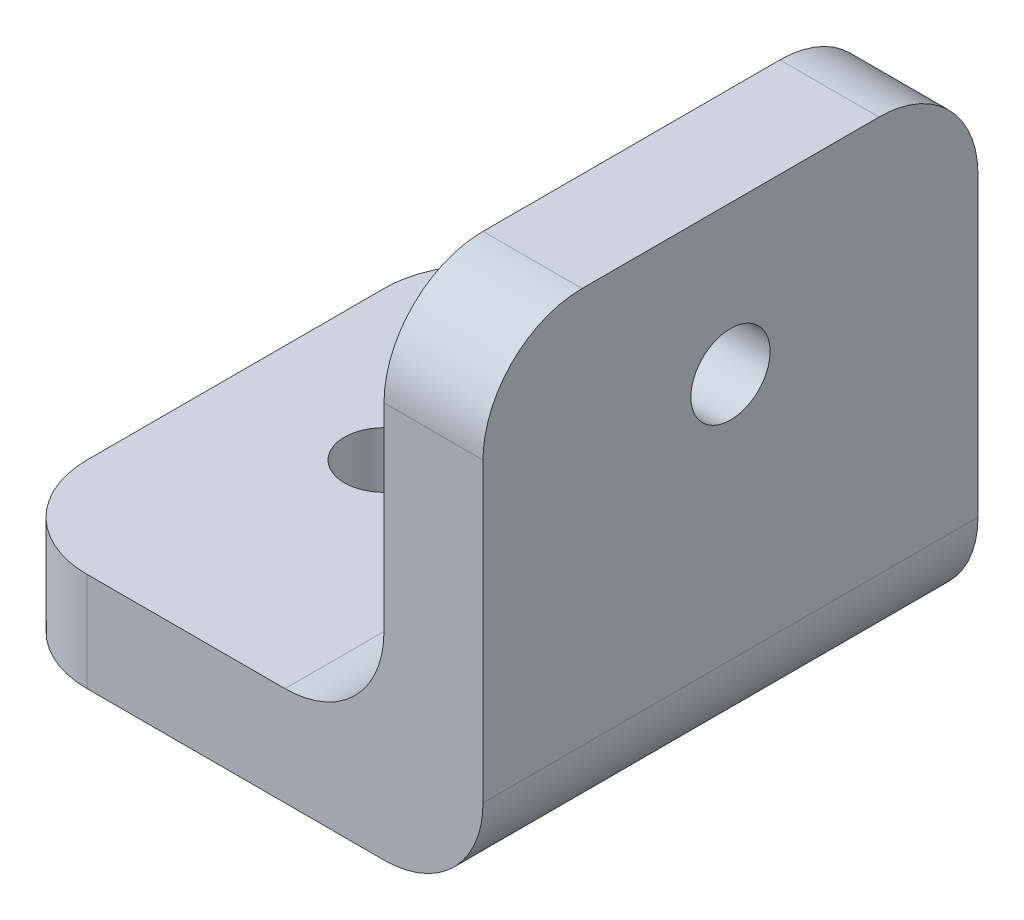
ISO-10303-21;
HEADER;
FILE_DESCRIPTION(('STEP AP214'),'2;1');
FILE_NAME('part.step','',(''),(''),'','','');
FILE_SCHEMA(('AUTOMOTIVE_DESIGN { 1 0 10303 214 1 1 1 1 }'));
ENDSEC;
DATA;
#1=APPLICATION_CONTEXT('core data for automotive mechanical design processes');
#2=APPLICATION_PROTOCOL_DEFINITION('international standard','automotive_design',2000,#1);
#3=PRODUCT_CONTEXT('',#1,'mechanical');
#4=PRODUCT('Part','Part','',(#3));
#5=PRODUCT_RELATED_PRODUCT_CATEGORY('part','',(#4));
#6=PRODUCT_DEFINITION_FORMATION('','',#4);
#7=PRODUCT_DEFINITION_CONTEXT('part definition',#1,'design');
#8=PRODUCT_DEFINITION('design','',#6,#7);
#9=PRODUCT_DEFINITION_SHAPE('','',#8);
#10=(LENGTH_UNIT() NAMED_UNIT(*) SI_UNIT(.MILLI.,.METRE.));
#11=(NAMED_UNIT(*) PLANE_ANGLE_UNIT() SI_UNIT($,.RADIAN.));
#12=(NAMED_UNIT(*) SI_UNIT($,.STERADIAN.) SOLID_ANGLE_UNIT());
#13=UNCERTAINTY_MEASURE_WITH_UNIT(LENGTH_MEASURE(1.E-05),#10,'distance_accuracy_value','');
#14=(GEOMETRIC_REPRESENTATION_CONTEXT(3) GLOBAL_UNCERTAINTY_ASSIGNED_CONTEXT((#13)) GLOBAL_UNIT_ASSIGNED_CONTEXT((#10,
#11,#12)) REPRESENTATION_CONTEXT('',''));
#15=CARTESIAN_POINT('',(0.,0.,0.));
#16=DIRECTION('',(0.,0.,1.));
#17=DIRECTION('',(1.,0.,0.));
#18=AXIS2_PLACEMENT_3D('',#15,#16,#17);
#19=CARTESIAN_POINT('',(0.,0.,50.));
#20=DIRECTION('',(1.,0.,0.));
#21=DIRECTION('',(0.,0.,-1.));
#22=AXIS2_PLACEMENT_3D('',#19,#20,#21);
#23=PLANE('',#22);
#24=DIRECTION('',(0.,0.,-1.));
#25=VECTOR('',#24,1.);
#26=CARTESIAN_POINT('',(0.,10.,50.));
#27=LINE('',#26,#25);
#28=CARTESIAN_POINT('',(0.,10.,40.));
#29=VERTEX_POINT('',#28);
#30=CARTESIAN_POINT('',(0.,10.,9.99999999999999));
#31=VERTEX_POINT('',#30);
#32=EDGE_CURVE('E426',#29,#31,#27,.T.);
#33=ORIENTED_EDGE('',*,*,#32,.T.);
#34=CARTESIAN_POINT('',(0.,30.,10.));
#35=CARTESIAN_POINT('',(0.,23.3333333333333,10.));
#36=CARTESIAN_POINT('',(0.,16.6666666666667,10.));
#37=CARTESIAN_POINT('',(0.,10.,10.));
#38=CARTESIAN_POINT('',(0.,6.66666666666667,10.));
#39=CARTESIAN_POINT('',(0.,3.33333333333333,10.));
#40=CARTESIAN_POINT('',(0.,0.,10.));
#41=CARTESIAN_POINT('',(0.,-6.66666666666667,10.));
#42=CARTESIAN_POINT('',(0.,-13.3333333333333,10.));
#43=CARTESIAN_POINT('',(0.,-20.,10.));
#44=(BOUNDED_CURVE() B_SPLINE_CURVE(3,(#34,#35,#36,#37,#38,#39,#40,#41,#42,#43),.UNSPECIFIED.,
.F.,.F.) B_SPLINE_CURVE_WITH_KNOTS((4,3,3,4),(-0.03,-0.01,0.,0.02),
.UNSPECIFIED.) CURVE() GEOMETRIC_REPRESENTATION_ITEM() RATIONAL_B_SPLINE_CURVE((1.,1.,1.,1.,1.,
1.,1.,1.,1.,1.)) REPRESENTATION_ITEM(''));
#45=CARTESIAN_POINT('',(0.,0.,9.99999999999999));
#46=VERTEX_POINT('',#45);
#47=EDGE_CURVE('E164',#31,#46,#44,.T.);
#48=ORIENTED_EDGE('',*,*,#47,.T.);
#49=DIRECTION('',(0.,0.,-1.));
#50=VECTOR('',#49,1.);
#51=CARTESIAN_POINT('',(0.,0.,50.));
#52=LINE('',#51,#50);
#53=CARTESIAN_POINT('',(0.,0.,40.));
#54=VERTEX_POINT('',#53);
#55=EDGE_CURVE('E148',#54,#46,#52,.T.);
#56=ORIENTED_EDGE('',*,*,#55,.F.);
#57=CARTESIAN_POINT('',(0.,30.,40.));
#58=CARTESIAN_POINT('',(0.,23.3333333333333,40.));
#59=CARTESIAN_POINT('',(0.,16.6666666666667,40.));
#60=CARTESIAN_POINT('',(0.,10.,40.));
#61=CARTESIAN_POINT('',(0.,6.66666666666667,40.));
#62=CARTESIAN_POINT('',(0.,3.33333333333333,40.));
#63=CARTESIAN_POINT('',(0.,0.,40.));
#64=CARTESIAN_POINT('',(0.,-6.66666666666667,40.));
#65=CARTESIAN_POINT('',(0.,-13.3333333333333,40.));
#66=CARTESIAN_POINT('',(0.,-20.,40.));
#67=(BOUNDED_CURVE() B_SPLINE_CURVE(3,(#57,#58,#59,#60,#61,#62,#63,#64,#65,#66),.UNSPECIFIED.,
.F.,.F.) B_SPLINE_CURVE_WITH_KNOTS((4,3,3,4),(-0.03,-0.01,0.,0.02),
.UNSPECIFIED.) CURVE() GEOMETRIC_REPRESENTATION_ITEM() RATIONAL_B_SPLINE_CURVE((1.,1.,1.,1.,1.,
1.,1.,1.,1.,1.)) REPRESENTATION_ITEM(''));
#68=EDGE_CURVE('E161',#54,#29,#67,.F.);
#69=ORIENTED_EDGE('',*,*,#68,.T.);
#70=EDGE_LOOP('',(#33,#48,#56,#69));
#71=FACE_BOUND('',#70,.T.);
#72=ADVANCED_FACE('F46',(#71),#23,.F.);
#73=CARTESIAN_POINT('',(0.,0.,50.));
#74=DIRECTION('',(0.,1.,0.));
#75=DIRECTION('',(0.,0.,1.));
#76=AXIS2_PLACEMENT_3D('',#73,#74,#75);
#77=PLANE('',#76);
#78=CARTESIAN_POINT('',(15.,0.,25.));
#79=DIRECTION('',(0.,1.,0.));
#80=DIRECTION('',(0.,0.,1.));
#81=AXIS2_PLACEMENT_3D('',#78,#79,#80);
#82=CIRCLE('',#81,4.);
#83=CARTESIAN_POINT('',(15.,0.,29.));
#84=VERTEX_POINT('',#83);
#85=EDGE_CURVE('E444',#84,#84,#82,.T.);
#86=ORIENTED_EDGE('',*,*,#85,.T.);
#87=EDGE_LOOP('',(#86));
#88=FACE_BOUND('',#87,.T.);
#89=ORIENTED_EDGE('',*,*,#55,.T.);
#90=CARTESIAN_POINT('',(0.,0.,10.));
#91=CARTESIAN_POINT('',(-3.02437820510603E-05,0.,9.71873940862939));
#92=CARTESIAN_POINT('',(0.0118648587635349,0.,9.43748316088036));
#93=CARTESIAN_POINT('',(0.0592873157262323,0.,8.87698298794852));
#94=CARTESIAN_POINT('',(0.0948135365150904,0.,8.59773896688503));
#95=CARTESIAN_POINT('',(0.189244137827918,0.,8.04344901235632));
#96=CARTESIAN_POINT('',(0.248130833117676,0.,7.76840006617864));
#97=CARTESIAN_POINT('',(0.388854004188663,0.,7.22424096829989));
#98=CARTESIAN_POINT('',(0.470690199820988,0.,6.95513074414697));
#99=CARTESIAN_POINT('',(0.656778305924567,0.,6.42463096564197));
#100=CARTESIAN_POINT('',(0.761040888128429,0.,6.16324515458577));
#101=CARTESIAN_POINT('',(0.99121911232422,0.,5.65018139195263));
#102=CARTESIAN_POINT('',(1.1171352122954,0.,5.39850364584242));
#103=CARTESIAN_POINT('',(1.38969862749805,0.,4.90669683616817));
#104=CARTESIAN_POINT('',(1.53634211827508,0.,4.66656565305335));
#105=CARTESIAN_POINT('',(1.8493345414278,0.,4.19951051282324));
#106=CARTESIAN_POINT('',(2.01568336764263,0.,3.97258648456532));
#107=CARTESIAN_POINT('',(2.36690343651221,0.,3.53355882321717));
#108=CARTESIAN_POINT('',(2.55177454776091,0.,3.32145508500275));
#109=CARTESIAN_POINT('',(2.93872607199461,0.,2.91357387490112));
#110=CARTESIAN_POINT('',(3.14080648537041,0.,2.71779640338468));
#111=CARTESIAN_POINT('',(3.56078311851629,0.,2.34392120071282));
#112=CARTESIAN_POINT('',(3.77868255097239,0.,2.165827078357));
#113=CARTESIAN_POINT('',(4.22870763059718,0.,1.82863295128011));
#114=CARTESIAN_POINT('',(4.46083305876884,0.,1.66953265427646));
#115=CARTESIAN_POINT('',(4.93771416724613,0.,1.37142258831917));
#116=CARTESIAN_POINT('',(5.18247251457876,0.,1.23241708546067));
#117=CARTESIAN_POINT('',(5.68282532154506,0.,0.975528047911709));
#118=CARTESIAN_POINT('',(5.93841960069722,0.,0.857644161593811));
#119=CARTESIAN_POINT('',(6.45852377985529,0.,0.643882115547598));
#120=CARTESIAN_POINT('',(6.72302953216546,0.,0.547993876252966));
#121=CARTESIAN_POINT('',(7.25907349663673,0.,0.378859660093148));
#122=CARTESIAN_POINT('',(7.53061000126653,0.,0.305608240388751));
#123=CARTESIAN_POINT('',(8.16492641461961,0.,0.162897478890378));
#124=CARTESIAN_POINT('',(8.52964507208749,0.,0.101812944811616));
#125=CARTESIAN_POINT('',(9.07965111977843,0.,0.0407323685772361));
#126=CARTESIAN_POINT('',(9.26338107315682,0.,0.0254632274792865));
#127=CARTESIAN_POINT('',(9.63139228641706,0.,0.00509827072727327));
#128=CARTESIAN_POINT('',(9.81567351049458,0.,1.80814562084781E-06));
#129=CARTESIAN_POINT('',(10.,0.,0.));
#130=B_SPLINE_CURVE_WITH_KNOTS('',3,(#90,#91,#92,#93,#94,#95,#96,#97,#98,#99,#100,#101,#102,
#103,#104,#105,#106,#107,#108,#109,#110,#111,#112,#113,#114,#115,#116,#117,#118,#119,#120,#121,
#122,#123,#124,#125,#126,#127,#128,#129),.UNSPECIFIED.,.F.,.F.,(4,2,2,2,2,2,2,2,2,2,2,2,2,2,2,2,
2,2,2,4),(0.,0.843524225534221,1.68700798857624,2.52985440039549,3.37269052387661,
4.2159286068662,5.05918452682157,5.90228505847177,6.74538104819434,7.58847105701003,
8.43156108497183,9.27482281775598,10.1180715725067,10.9614990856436,11.804912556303,
12.6479387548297,13.4907620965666,14.5975846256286,15.1504384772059,15.7032571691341),.UNSPECIFIED.);
#131=CARTESIAN_POINT('',(10.,0.,0.));
#132=VERTEX_POINT('',#131);
#133=EDGE_CURVE('E155',#46,#132,#130,.T.);
#134=ORIENTED_EDGE('',*,*,#133,.T.);
#135=DIRECTION('',(1.,0.,0.));
#136=VECTOR('',#135,1.);
#137=CARTESIAN_POINT('',(0.,0.,0.));
#138=LINE('',#137,#136);
#139=CARTESIAN_POINT('',(40.,0.,0.));
#140=VERTEX_POINT('',#139);
#141=EDGE_CURVE('E433',#132,#140,#138,.T.);
#142=ORIENTED_EDGE('',*,*,#141,.T.);
#143=CARTESIAN_POINT('',(40.,0.,150.));
#144=CARTESIAN_POINT('',(40.,0.,116.666666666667));
#145=CARTESIAN_POINT('',(40.,0.,83.3333333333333));
#146=CARTESIAN_POINT('',(40.,0.,50.));
#147=CARTESIAN_POINT('',(40.,0.,33.3333333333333));
#148=CARTESIAN_POINT('',(40.,0.,16.6666666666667));
#149=CARTESIAN_POINT('',(40.,0.,0.));
#150=CARTESIAN_POINT('',(40.,0.,-33.3333333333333));
#151=CARTESIAN_POINT('',(40.,0.,-66.6666666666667));
#152=CARTESIAN_POINT('',(40.,0.,-100.));
#153=(BOUNDED_CURVE() B_SPLINE_CURVE(3,(#143,#144,#145,#146,#147,#148,#149,#150,#151,#152),
.UNSPECIFIED.,.F.,.F.) B_SPLINE_CURVE_WITH_KNOTS((4,3,3,4),(-0.1,0.,0.05,0.15),
.UNSPECIFIED.) CURVE() GEOMETRIC_REPRESENTATION_ITEM() RATIONAL_B_SPLINE_CURVE((1.,1.,1.,1.,1.,
1.,1.,1.,1.,1.)) REPRESENTATION_ITEM(''));
#154=CARTESIAN_POINT('',(40.,0.,50.));
#155=VERTEX_POINT('',#154);
#156=EDGE_CURVE('E156',#140,#155,#153,.F.);
#157=ORIENTED_EDGE('',*,*,#156,.T.);
#158=DIRECTION('',(1.,0.,0.));
#159=VECTOR('',#158,1.);
#160=CARTESIAN_POINT('',(0.,0.,50.));
#161=LINE('',#160,#159);
#162=CARTESIAN_POINT('',(10.,0.,50.));
#163=VERTEX_POINT('',#162);
#164=EDGE_CURVE('E150',#163,#155,#161,.T.);
#165=ORIENTED_EDGE('',*,*,#164,.F.);
#166=CARTESIAN_POINT('',(10.,0.,50.));
#167=CARTESIAN_POINT('',(9.71873940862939,0.,50.0000302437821));
#168=CARTESIAN_POINT('',(9.43748316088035,0.,49.9881351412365));
#169=CARTESIAN_POINT('',(8.87698298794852,0.,49.9407126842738));
#170=CARTESIAN_POINT('',(8.59773896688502,0.,49.9051864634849));
#171=CARTESIAN_POINT('',(8.04344901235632,0.,49.8107558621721));
#172=CARTESIAN_POINT('',(7.76840006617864,0.,49.7518691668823));
#173=CARTESIAN_POINT('',(7.22424096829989,0.,49.6111459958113));
#174=CARTESIAN_POINT('',(6.95513074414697,0.,49.529309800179));
#175=CARTESIAN_POINT('',(6.42463096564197,0.,49.3432216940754));
#176=CARTESIAN_POINT('',(6.16324515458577,0.,49.2389591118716));
#177=CARTESIAN_POINT('',(5.65018139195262,0.,49.0087808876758));
#178=CARTESIAN_POINT('',(5.39850364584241,0.,48.8828647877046));
#179=CARTESIAN_POINT('',(4.90669683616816,0.,48.610301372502));
#180=CARTESIAN_POINT('',(4.66656565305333,0.,48.4636578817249));
#181=CARTESIAN_POINT('',(4.19951051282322,0.,48.1506654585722));
#182=CARTESIAN_POINT('',(3.97258648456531,0.,47.9843166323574));
#183=CARTESIAN_POINT('',(3.53355882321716,0.,47.6330965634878));
#184=CARTESIAN_POINT('',(3.32145508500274,0.,47.4482254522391));
#185=CARTESIAN_POINT('',(2.91357387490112,0.,47.0612739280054));
#186=CARTESIAN_POINT('',(2.71779640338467,0.,46.8591935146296));
#187=CARTESIAN_POINT('',(2.34392120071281,0.,46.4392168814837));
#188=CARTESIAN_POINT('',(2.16582707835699,0.,46.2213174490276));
#189=CARTESIAN_POINT('',(1.8286329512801,0.,45.7712923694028));
#190=CARTESIAN_POINT('',(1.66953265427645,0.,45.5391669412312));
#191=CARTESIAN_POINT('',(1.37142258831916,0.,45.0622858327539));
#192=CARTESIAN_POINT('',(1.23241708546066,0.,44.8175274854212));
#193=CARTESIAN_POINT('',(0.975528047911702,0.,44.3171746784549));
#194=CARTESIAN_POINT('',(0.857644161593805,0.,44.0615803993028));
#195=CARTESIAN_POINT('',(0.643882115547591,0.,43.5414762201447));
#196=CARTESIAN_POINT('',(0.547993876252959,0.,43.2769704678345));
#197=CARTESIAN_POINT('',(0.378859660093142,0.,42.7409265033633));
#198=CARTESIAN_POINT('',(0.305608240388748,0.,42.4693899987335));
#199=CARTESIAN_POINT('',(0.162897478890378,0.,41.8350735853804));
#200=CARTESIAN_POINT('',(0.101812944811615,0.,41.4703549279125));
#201=CARTESIAN_POINT('',(0.0407323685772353,0.,40.9203488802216));
#202=CARTESIAN_POINT('',(0.0254632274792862,0.,40.7366189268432));
#203=CARTESIAN_POINT('',(0.00509827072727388,0.,40.368607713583));
#204=CARTESIAN_POINT('',(1.80814562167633E-06,0.,40.1843264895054));
#205=CARTESIAN_POINT('',(0.,0.,40.));
#206=B_SPLINE_CURVE_WITH_KNOTS('',3,(#166,#167,#168,#169,#170,#171,#172,#173,#174,#175,#176,
#177,#178,#179,#180,#181,#182,#183,#184,#185,#186,#187,#188,#189,#190,#191,#192,#193,#194,#195,
#196,#197,#198,#199,#200,#201,#202,#203,#204,#205),.UNSPECIFIED.,.F.,.F.,(4,2,2,2,2,2,2,2,2,2,2,
2,2,2,2,2,2,2,2,4),(0.,0.843524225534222,1.68700798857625,2.5298544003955,3.37269052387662,
4.2159286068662,5.05918452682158,5.90228505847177,6.74538104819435,7.58847105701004,
8.43156108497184,9.27482281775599,10.1180715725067,10.9614990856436,11.804912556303,
12.6479387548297,13.4907620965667,14.5975846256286,15.1504384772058,15.7032571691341),.UNSPECIFIED.);
#207=EDGE_CURVE('E145',#163,#54,#206,.T.);
#208=ORIENTED_EDGE('',*,*,#207,.T.);
#209=EDGE_LOOP('',(#89,#134,#142,#157,#165,#208));
#210=FACE_BOUND('',#209,.T.);
#211=ADVANCED_FACE('F147',(#88,#210),#77,.F.);
#212=CARTESIAN_POINT('',(50.,0.,50.));
#213=DIRECTION('',(-1.,0.,0.));
#214=DIRECTION('',(0.,0.,1.));
#215=AXIS2_PLACEMENT_3D('',#212,#213,#214);
#216=PLANE('',#215);
#217=CARTESIAN_POINT('',(50.,35.,25.));
#218=DIRECTION('',(-1.,0.,0.));
#219=DIRECTION('',(0.,0.,1.));
#220=AXIS2_PLACEMENT_3D('',#217,#218,#219);
#221=CIRCLE('',#220,4.);
#222=CARTESIAN_POINT('',(50.,35.,29.));
#223=VERTEX_POINT('',#222);
#224=EDGE_CURVE('E435',#223,#223,#221,.T.);
#225=ORIENTED_EDGE('',*,*,#224,.T.);
#226=EDGE_LOOP('',(#225));
#227=FACE_BOUND('',#226,.T.);
#228=DIRECTION('',(0.,1.,0.));
#229=VECTOR('',#228,1.);
#230=CARTESIAN_POINT('',(50.,0.,0.));
#231=LINE('',#230,#229);
#232=CARTESIAN_POINT('',(50.,10.,0.));
#233=VERTEX_POINT('',#232);
#234=CARTESIAN_POINT('',(50.,40.,0.));
#235=VERTEX_POINT('',#234);
#236=EDGE_CURVE('E339',#233,#235,#231,.T.);
#237=ORIENTED_EDGE('',*,*,#236,.T.);
#238=CARTESIAN_POINT('',(50.,40.,0.));
#239=CARTESIAN_POINT('',(50.,40.2812605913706,-3.02437820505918E-05));
#240=CARTESIAN_POINT('',(50.,40.5625168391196,0.011864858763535));
#241=CARTESIAN_POINT('',(50.,41.1230170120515,0.0592873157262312));
#242=CARTESIAN_POINT('',(50.,41.402261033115,0.0948135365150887));
#243=CARTESIAN_POINT('',(50.,41.9565509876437,0.189244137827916));
#244=CARTESIAN_POINT('',(50.,42.2315999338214,0.248130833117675));
#245=CARTESIAN_POINT('',(50.,42.7757590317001,0.388854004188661));
#246=CARTESIAN_POINT('',(50.,43.044869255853,0.470690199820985));
#247=CARTESIAN_POINT('',(50.,43.575369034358,0.656778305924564));
#248=CARTESIAN_POINT('',(50.,43.8367548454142,0.761040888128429));
#249=CARTESIAN_POINT('',(50.,44.3498186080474,0.991219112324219));
#250=CARTESIAN_POINT('',(50.,44.6014963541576,1.1171352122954));
#251=CARTESIAN_POINT('',(50.,45.0933031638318,1.38969862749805));
#252=CARTESIAN_POINT('',(50.,45.3334343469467,1.53634211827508));
#253=CARTESIAN_POINT('',(50.,45.8004894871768,1.8493345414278));
#254=CARTESIAN_POINT('',(50.,46.0274135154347,2.01568336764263));
#255=CARTESIAN_POINT('',(50.,46.4664411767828,2.3669034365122));
#256=CARTESIAN_POINT('',(50.,46.6785449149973,2.5517745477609));
#257=CARTESIAN_POINT('',(50.,47.0864261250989,2.93872607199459));
#258=CARTESIAN_POINT('',(50.,47.2822035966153,3.14080648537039));
#259=CARTESIAN_POINT('',(50.,47.6560787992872,3.56078311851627));
#260=CARTESIAN_POINT('',(50.,47.834172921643,3.77868255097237));
#261=CARTESIAN_POINT('',(50.,48.1713670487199,4.22870763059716));
#262=CARTESIAN_POINT('',(50.,48.3304673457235,4.46083305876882));
#263=CARTESIAN_POINT('',(50.,48.6285774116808,4.93771416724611));
#264=CARTESIAN_POINT('',(50.,48.7675829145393,5.18247251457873));
#265=CARTESIAN_POINT('',(50.,49.0244719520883,5.68282532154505));
#266=CARTESIAN_POINT('',(50.,49.1423558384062,5.93841960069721));
#267=CARTESIAN_POINT('',(50.,49.3561178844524,6.45852377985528));
#268=CARTESIAN_POINT('',(50.,49.452006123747,6.72302953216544));
#269=CARTESIAN_POINT('',(50.,49.6211403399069,7.25907349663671));
#270=CARTESIAN_POINT('',(50.,49.6943917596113,7.53061000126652));
#271=CARTESIAN_POINT('',(50.,49.8371025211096,8.1649264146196));
#272=CARTESIAN_POINT('',(50.,49.8981870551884,8.52964507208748));
#273=CARTESIAN_POINT('',(50.,49.9592676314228,9.07965111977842));
#274=CARTESIAN_POINT('',(50.,49.9745367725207,9.26338107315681));
#275=CARTESIAN_POINT('',(50.,49.9949017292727,9.63139228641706));
#276=CARTESIAN_POINT('',(50.,49.9999981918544,9.81567351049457));
#277=CARTESIAN_POINT('',(50.,50.,10.));
#278=B_SPLINE_CURVE_WITH_KNOTS('',3,(#238,#239,#240,#241,#242,#243,#244,#245,#246,#247,#248,
#249,#250,#251,#252,#253,#254,#255,#256,#257,#258,#259,#260,#261,#262,#263,#264,#265,#266,#267,
#268,#269,#270,#271,#272,#273,#274,#275,#276,#277),.UNSPECIFIED.,.F.,.F.,(4,2,2,2,2,2,2,2,2,2,2,
2,2,2,2,2,2,2,2,4),(0.,0.843524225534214,1.68700798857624,2.52985440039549,3.37269052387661,
4.21592860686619,5.05918452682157,5.90228505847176,6.74538104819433,7.58847105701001,
8.43156108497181,9.27482281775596,10.1180715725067,10.9614990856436,11.804912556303,
12.6479387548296,13.4907620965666,14.5975846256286,15.1504384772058,15.7032571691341),.UNSPECIFIED.);
#279=CARTESIAN_POINT('',(50.,50.,9.99999999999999));
#280=VERTEX_POINT('',#279);
#281=EDGE_CURVE('E70',#235,#280,#278,.T.);
#282=ORIENTED_EDGE('',*,*,#281,.T.);
#283=DIRECTION('',(0.,0.,-1.));
#284=VECTOR('',#283,1.);
#285=CARTESIAN_POINT('',(50.,50.,50.));
#286=LINE('',#285,#284);
#287=CARTESIAN_POINT('',(50.,50.,40.));
#288=VERTEX_POINT('',#287);
#289=EDGE_CURVE('E165',#288,#280,#286,.T.);
#290=ORIENTED_EDGE('',*,*,#289,.F.);
#291=CARTESIAN_POINT('',(50.,50.,40.));
#292=CARTESIAN_POINT('',(50.,50.0000302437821,40.2812605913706));
#293=CARTESIAN_POINT('',(50.,49.9881351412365,40.5625168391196));
#294=CARTESIAN_POINT('',(50.,49.9407126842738,41.1230170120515));
#295=CARTESIAN_POINT('',(50.,49.9051864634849,41.402261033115));
#296=CARTESIAN_POINT('',(50.,49.8107558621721,41.9565509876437));
#297=CARTESIAN_POINT('',(50.,49.7518691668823,42.2315999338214));
#298=CARTESIAN_POINT('',(50.,49.6111459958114,42.7757590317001));
#299=CARTESIAN_POINT('',(50.,49.529309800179,43.044869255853));
#300=CARTESIAN_POINT('',(50.,49.3432216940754,43.575369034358));
#301=CARTESIAN_POINT('',(50.,49.2389591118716,43.8367548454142));
#302=CARTESIAN_POINT('',(50.,49.0087808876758,44.3498186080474));
#303=CARTESIAN_POINT('',(50.,48.8828647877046,44.6014963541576));
#304=CARTESIAN_POINT('',(50.,48.610301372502,45.0933031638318));
#305=CARTESIAN_POINT('',(50.,48.4636578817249,45.3334343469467));
#306=CARTESIAN_POINT('',(50.,48.1506654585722,45.8004894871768));
#307=CARTESIAN_POINT('',(50.,47.9843166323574,46.0274135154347));
#308=CARTESIAN_POINT('',(50.,47.6330965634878,46.4664411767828));
#309=CARTESIAN_POINT('',(50.,47.4482254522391,46.6785449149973));
#310=CARTESIAN_POINT('',(50.,47.0612739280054,47.0864261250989));
#311=CARTESIAN_POINT('',(50.,46.8591935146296,47.2822035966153));
#312=CARTESIAN_POINT('',(50.,46.4392168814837,47.6560787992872));
#313=CARTESIAN_POINT('',(50.,46.2213174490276,47.834172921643));
#314=CARTESIAN_POINT('',(50.,45.7712923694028,48.1713670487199));
#315=CARTESIAN_POINT('',(50.,45.5391669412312,48.3304673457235));
#316=CARTESIAN_POINT('',(50.,45.0622858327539,48.6285774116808));
#317=CARTESIAN_POINT('',(50.,44.8175274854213,48.7675829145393));
#318=CARTESIAN_POINT('',(50.,44.3171746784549,49.0244719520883));
#319=CARTESIAN_POINT('',(50.,44.0615803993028,49.1423558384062));
#320=CARTESIAN_POINT('',(50.,43.5414762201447,49.3561178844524));
#321=CARTESIAN_POINT('',(50.,43.2769704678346,49.452006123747));
#322=CARTESIAN_POINT('',(50.,42.7409265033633,49.6211403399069));
#323=CARTESIAN_POINT('',(50.,42.4693899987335,49.6943917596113));
#324=CARTESIAN_POINT('',(50.,41.8350735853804,49.8371025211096));
#325=CARTESIAN_POINT('',(50.,41.4703549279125,49.8981870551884));
#326=CARTESIAN_POINT('',(50.,40.9203488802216,49.9592676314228));
#327=CARTESIAN_POINT('',(50.,40.7366189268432,49.9745367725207));
#328=CARTESIAN_POINT('',(50.,40.3686077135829,49.9949017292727));
#329=CARTESIAN_POINT('',(50.,40.1843264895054,49.9999981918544));
#330=CARTESIAN_POINT('',(50.,40.,50.));
#331=B_SPLINE_CURVE_WITH_KNOTS('',3,(#291,#292,#293,#294,#295,#296,#297,#298,#299,#300,#301,
#302,#303,#304,#305,#306,#307,#308,#309,#310,#311,#312,#313,#314,#315,#316,#317,#318,#319,#320,
#321,#322,#323,#324,#325,#326,#327,#328,#329,#330),.UNSPECIFIED.,.F.,.F.,(4,2,2,2,2,2,2,2,2,2,2,
2,2,2,2,2,2,2,2,4),(0.,0.843524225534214,1.68700798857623,2.52985440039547,3.3726905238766,
4.21592860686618,5.05918452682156,5.90228505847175,6.74538104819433,7.58847105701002,
8.43156108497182,9.27482281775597,10.1180715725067,10.9614990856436,11.804912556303,
12.6479387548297,13.4907620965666,14.5975846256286,15.1504384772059,15.7032571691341),.UNSPECIFIED.);
#332=CARTESIAN_POINT('',(50.,40.,50.));
#333=VERTEX_POINT('',#332);
#334=EDGE_CURVE('E312',#288,#333,#331,.T.);
#335=ORIENTED_EDGE('',*,*,#334,.T.);
#336=DIRECTION('',(0.,1.,0.));
#337=VECTOR('',#336,1.);
#338=CARTESIAN_POINT('',(50.,0.,50.));
#339=LINE('',#338,#337);
#340=CARTESIAN_POINT('',(50.,10.,50.));
#341=VERTEX_POINT('',#340);
#342=EDGE_CURVE('E381',#341,#333,#339,.T.);
#343=ORIENTED_EDGE('',*,*,#342,.F.);
#344=CARTESIAN_POINT('',(50.,10.,150.));
#345=CARTESIAN_POINT('',(50.,10.,116.666666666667));
#346=CARTESIAN_POINT('',(50.,10.,83.3333333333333));
#347=CARTESIAN_POINT('',(50.,10.,50.));
#348=CARTESIAN_POINT('',(50.,10.,33.3333333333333));
#349=CARTESIAN_POINT('',(50.,10.,16.6666666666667));
#350=CARTESIAN_POINT('',(50.,10.,0.));
#351=CARTESIAN_POINT('',(50.,10.,-33.3333333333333));
#352=CARTESIAN_POINT('',(50.,10.,-66.6666666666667));
#353=CARTESIAN_POINT('',(50.,10.,-100.));
#354=(BOUNDED_CURVE() B_SPLINE_CURVE(3,(#344,#345,#346,#347,#348,#349,#350,#351,#352,#353),
.UNSPECIFIED.,.F.,.F.) B_SPLINE_CURVE_WITH_KNOTS((4,3,3,4),(-0.1,0.,0.05,0.15),
.UNSPECIFIED.) CURVE() GEOMETRIC_REPRESENTATION_ITEM() RATIONAL_B_SPLINE_CURVE((1.,1.,1.,1.,1.,
1.,1.,1.,1.,1.)) REPRESENTATION_ITEM(''));
#355=EDGE_CURVE('E283',#341,#233,#354,.T.);
#356=ORIENTED_EDGE('',*,*,#355,.T.);
#357=EDGE_LOOP('',(#237,#282,#290,#335,#343,#356));
#358=FACE_BOUND('',#357,.T.);
#359=ADVANCED_FACE('F211',(#227,#358),#216,.F.);
#360=CARTESIAN_POINT('',(50.,50.,50.));
#361=DIRECTION('',(0.,-1.,0.));
#362=DIRECTION('',(0.,0.,-1.));
#363=AXIS2_PLACEMENT_3D('',#360,#361,#362);
#364=PLANE('',#363);
#365=ORIENTED_EDGE('',*,*,#289,.T.);
#366=CARTESIAN_POINT('',(70.,50.,10.));
#367=CARTESIAN_POINT('',(63.3333333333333,50.,10.));
#368=CARTESIAN_POINT('',(56.6666666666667,50.,10.));
#369=CARTESIAN_POINT('',(50.,50.,10.));
#370=CARTESIAN_POINT('',(46.6666666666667,50.,10.));
#371=CARTESIAN_POINT('',(43.3333333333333,50.,10.));
#372=CARTESIAN_POINT('',(40.,50.,10.));
#373=CARTESIAN_POINT('',(33.3333333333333,50.,10.));
#374=CARTESIAN_POINT('',(26.6666666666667,50.,10.));
#375=CARTESIAN_POINT('',(20.,50.,10.));
#376=(BOUNDED_CURVE() B_SPLINE_CURVE(3,(#366,#367,#368,#369,#370,#371,#372,#373,#374,#375),
.UNSPECIFIED.,.F.,.F.) B_SPLINE_CURVE_WITH_KNOTS((4,3,3,4),(-0.02,0.,0.01,0.03),
.UNSPECIFIED.) CURVE() GEOMETRIC_REPRESENTATION_ITEM() RATIONAL_B_SPLINE_CURVE((1.,1.,1.,1.,1.,
1.,1.,1.,1.,1.)) REPRESENTATION_ITEM(''));
#377=CARTESIAN_POINT('',(40.,50.,9.99999999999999));
#378=VERTEX_POINT('',#377);
#379=EDGE_CURVE('E342',#280,#378,#376,.T.);
#380=ORIENTED_EDGE('',*,*,#379,.T.);
#381=DIRECTION('',(0.,0.,-1.));
#382=VECTOR('',#381,1.);
#383=CARTESIAN_POINT('',(40.,50.,50.));
#384=LINE('',#383,#382);
#385=CARTESIAN_POINT('',(40.,50.,40.));
#386=VERTEX_POINT('',#385);
#387=EDGE_CURVE('E424',#386,#378,#384,.T.);
#388=ORIENTED_EDGE('',*,*,#387,.F.);
#389=CARTESIAN_POINT('',(70.,50.,40.));
#390=CARTESIAN_POINT('',(63.3333333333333,50.,40.));
#391=CARTESIAN_POINT('',(56.6666666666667,50.,40.));
#392=CARTESIAN_POINT('',(50.,50.,40.));
#393=CARTESIAN_POINT('',(46.6666666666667,50.,40.));
#394=CARTESIAN_POINT('',(43.3333333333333,50.,40.));
#395=CARTESIAN_POINT('',(40.,50.,40.));
#396=CARTESIAN_POINT('',(33.3333333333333,50.,40.));
#397=CARTESIAN_POINT('',(26.6666666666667,50.,40.));
#398=CARTESIAN_POINT('',(20.,50.,40.));
#399=(BOUNDED_CURVE() B_SPLINE_CURVE(3,(#389,#390,#391,#392,#393,#394,#395,#396,#397,#398),
.UNSPECIFIED.,.F.,.F.) B_SPLINE_CURVE_WITH_KNOTS((4,3,3,4),(-0.02,0.,0.01,0.03),
.UNSPECIFIED.) CURVE() GEOMETRIC_REPRESENTATION_ITEM() RATIONAL_B_SPLINE_CURVE((1.,1.,1.,1.,1.,
1.,1.,1.,1.,1.)) REPRESENTATION_ITEM(''));
#400=EDGE_CURVE('E77',#386,#288,#399,.F.);
#401=ORIENTED_EDGE('',*,*,#400,.T.);
#402=EDGE_LOOP('',(#365,#380,#388,#401));
#403=FACE_BOUND('',#402,.T.);
#404=ADVANCED_FACE('F265',(#403),#364,.F.);
#405=CARTESIAN_POINT('',(40.,10.,50.));
#406=DIRECTION('',(1.,0.,0.));
#407=DIRECTION('',(0.,0.,-1.));
#408=AXIS2_PLACEMENT_3D('',#405,#406,#407);
#409=PLANE('',#408);
#410=CARTESIAN_POINT('',(40.,35.,25.));
#411=DIRECTION('',(-1.,0.,0.));
#412=DIRECTION('',(0.,0.,1.));
#413=AXIS2_PLACEMENT_3D('',#410,#411,#412);
#414=CIRCLE('',#413,4.);
#415=CARTESIAN_POINT('',(40.,35.,29.));
#416=VERTEX_POINT('',#415);
#417=EDGE_CURVE('E441',#416,#416,#414,.T.);
#418=ORIENTED_EDGE('',*,*,#417,.F.);
#419=EDGE_LOOP('',(#418));
#420=FACE_BOUND('',#419,.T.);
#421=ORIENTED_EDGE('',*,*,#387,.T.);
#422=CARTESIAN_POINT('',(40.,50.,10.));
#423=CARTESIAN_POINT('',(40.,50.0000302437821,9.71873940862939));
#424=CARTESIAN_POINT('',(40.,49.9881351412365,9.43748316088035));
#425=CARTESIAN_POINT('',(40.,49.9407126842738,8.87698298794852));
#426=CARTESIAN_POINT('',(40.,49.9051864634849,8.59773896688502));
#427=CARTESIAN_POINT('',(40.,49.8107558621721,8.04344901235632));
#428=CARTESIAN_POINT('',(40.,49.7518691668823,7.76840006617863));
#429=CARTESIAN_POINT('',(40.,49.6111459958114,7.22424096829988));
#430=CARTESIAN_POINT('',(40.,49.529309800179,6.95513074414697));
#431=CARTESIAN_POINT('',(40.,49.3432216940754,6.42463096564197));
#432=CARTESIAN_POINT('',(40.,49.2389591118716,6.16324515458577));
#433=CARTESIAN_POINT('',(40.,49.0087808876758,5.65018139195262));
#434=CARTESIAN_POINT('',(40.,48.8828647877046,5.39850364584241));
#435=CARTESIAN_POINT('',(40.,48.610301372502,4.90669683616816));
#436=CARTESIAN_POINT('',(40.,48.4636578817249,4.66656565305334));
#437=CARTESIAN_POINT('',(40.,48.1506654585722,4.19951051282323));
#438=CARTESIAN_POINT('',(40.,47.9843166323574,3.97258648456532));
#439=CARTESIAN_POINT('',(40.,47.6330965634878,3.53355882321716));
#440=CARTESIAN_POINT('',(40.,47.4482254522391,3.32145508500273));
#441=CARTESIAN_POINT('',(40.,47.0612739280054,2.91357387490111));
#442=CARTESIAN_POINT('',(40.,46.8591935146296,2.71779640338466));
#443=CARTESIAN_POINT('',(40.,46.4392168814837,2.34392120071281));
#444=CARTESIAN_POINT('',(40.,46.2213174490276,2.16582707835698));
#445=CARTESIAN_POINT('',(40.,45.7712923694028,1.82863295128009));
#446=CARTESIAN_POINT('',(40.,45.5391669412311,1.66953265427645));
#447=CARTESIAN_POINT('',(40.,45.0622858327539,1.37142258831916));
#448=CARTESIAN_POINT('',(40.,44.8175274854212,1.23241708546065));
#449=CARTESIAN_POINT('',(40.,44.3171746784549,0.975528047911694));
#450=CARTESIAN_POINT('',(40.,44.0615803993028,0.857644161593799));
#451=CARTESIAN_POINT('',(40.,43.5414762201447,0.643882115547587));
#452=CARTESIAN_POINT('',(40.,43.2769704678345,0.547993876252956));
#453=CARTESIAN_POINT('',(40.,42.7409265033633,0.378859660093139));
#454=CARTESIAN_POINT('',(40.,42.4693899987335,0.305608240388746));
#455=CARTESIAN_POINT('',(40.,41.8350735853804,0.162897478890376));
#456=CARTESIAN_POINT('',(40.,41.4703549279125,0.101812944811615));
#457=CARTESIAN_POINT('',(40.,40.9203488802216,0.0407323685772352));
#458=CARTESIAN_POINT('',(40.,40.7366189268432,0.0254632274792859));
#459=CARTESIAN_POINT('',(40.,40.368607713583,0.00509827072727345));
#460=CARTESIAN_POINT('',(40.,40.1843264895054,1.80814562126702E-06));
#461=CARTESIAN_POINT('',(40.,40.,0.));
#462=B_SPLINE_CURVE_WITH_KNOTS('',3,(#422,#423,#424,#425,#426,#427,#428,#429,#430,#431,#432,
#433,#434,#435,#436,#437,#438,#439,#440,#441,#442,#443,#444,#445,#446,#447,#448,#449,#450,#451,
#452,#453,#454,#455,#456,#457,#458,#459,#460,#461),.UNSPECIFIED.,.F.,.F.,(4,2,2,2,2,2,2,2,2,2,2,
2,2,2,2,2,2,2,2,4),(0.,0.843524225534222,1.68700798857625,2.5298544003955,3.37269052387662,
4.21592860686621,5.05918452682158,5.90228505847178,6.74538104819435,7.58847105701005,
8.43156108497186,9.27482281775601,10.1180715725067,10.9614990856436,11.804912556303,
12.6479387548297,13.4907620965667,14.5975846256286,15.1504384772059,15.7032571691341),.UNSPECIFIED.);
#463=CARTESIAN_POINT('',(40.,40.,0.));
#464=VERTEX_POINT('',#463);
#465=EDGE_CURVE('E277',#378,#464,#462,.T.);
#466=ORIENTED_EDGE('',*,*,#465,.T.);
#467=DIRECTION('',(0.,-1.,0.));
#468=VECTOR('',#467,1.);
#469=CARTESIAN_POINT('',(40.,10.,0.));
#470=LINE('',#469,#468);
#471=CARTESIAN_POINT('',(40.,20.,0.));
#472=VERTEX_POINT('',#471);
#473=EDGE_CURVE('E326',#464,#472,#470,.T.);
#474=ORIENTED_EDGE('',*,*,#473,.T.);
#475=CARTESIAN_POINT('',(40.,20.,150.));
#476=CARTESIAN_POINT('',(40.,20.,116.666666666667));
#477=CARTESIAN_POINT('',(40.,20.,83.3333333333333));
#478=CARTESIAN_POINT('',(40.,20.,50.));
#479=CARTESIAN_POINT('',(40.,20.,33.3333333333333));
#480=CARTESIAN_POINT('',(40.,20.,16.6666666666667));
#481=CARTESIAN_POINT('',(40.,20.,0.));
#482=CARTESIAN_POINT('',(40.,20.,-33.3333333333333));
#483=CARTESIAN_POINT('',(40.,20.,-66.6666666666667));
#484=CARTESIAN_POINT('',(40.,20.,-100.));
#485=(BOUNDED_CURVE() B_SPLINE_CURVE(3,(#475,#476,#477,#478,#479,#480,#481,#482,#483,#484),
.UNSPECIFIED.,.F.,.F.) B_SPLINE_CURVE_WITH_KNOTS((4,3,3,4),(-0.1,0.,0.05,0.15),
.UNSPECIFIED.) CURVE() GEOMETRIC_REPRESENTATION_ITEM() RATIONAL_B_SPLINE_CURVE((1.,1.,1.,1.,1.,
1.,1.,1.,1.,1.)) REPRESENTATION_ITEM(''));
#486=CARTESIAN_POINT('',(40.,20.,50.));
#487=VERTEX_POINT('',#486);
#488=EDGE_CURVE('E337',#472,#487,#485,.F.);
#489=ORIENTED_EDGE('',*,*,#488,.T.);
#490=DIRECTION('',(0.,-1.,0.));
#491=VECTOR('',#490,1.);
#492=CARTESIAN_POINT('',(40.,10.,50.));
#493=LINE('',#492,#491);
#494=CARTESIAN_POINT('',(40.,40.,50.));
#495=VERTEX_POINT('',#494);
#496=EDGE_CURVE('E388',#495,#487,#493,.T.);
#497=ORIENTED_EDGE('',*,*,#496,.F.);
#498=CARTESIAN_POINT('',(40.,40.,50.));
#499=CARTESIAN_POINT('',(40.,40.2812605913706,50.0000302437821));
#500=CARTESIAN_POINT('',(40.,40.5625168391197,49.9881351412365));
#501=CARTESIAN_POINT('',(40.,41.1230170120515,49.9407126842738));
#502=CARTESIAN_POINT('',(40.,41.402261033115,49.9051864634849));
#503=CARTESIAN_POINT('',(40.,41.9565509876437,49.8107558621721));
#504=CARTESIAN_POINT('',(40.,42.2315999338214,49.7518691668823));
#505=CARTESIAN_POINT('',(40.,42.7757590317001,49.6111459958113));
#506=CARTESIAN_POINT('',(40.,43.044869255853,49.529309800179));
#507=CARTESIAN_POINT('',(40.,43.575369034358,49.3432216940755));
#508=CARTESIAN_POINT('',(40.,43.8367548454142,49.2389591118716));
#509=CARTESIAN_POINT('',(40.,44.3498186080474,49.0087808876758));
#510=CARTESIAN_POINT('',(40.,44.6014963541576,48.8828647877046));
#511=CARTESIAN_POINT('',(40.,45.0933031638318,48.610301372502));
#512=CARTESIAN_POINT('',(40.,45.3334343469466,48.4636578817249));
#513=CARTESIAN_POINT('',(40.,45.8004894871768,48.1506654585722));
#514=CARTESIAN_POINT('',(40.,46.0274135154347,47.9843166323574));
#515=CARTESIAN_POINT('',(40.,46.4664411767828,47.6330965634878));
#516=CARTESIAN_POINT('',(40.,46.6785449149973,47.4482254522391));
#517=CARTESIAN_POINT('',(40.,47.0864261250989,47.0612739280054));
#518=CARTESIAN_POINT('',(40.,47.2822035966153,46.8591935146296));
#519=CARTESIAN_POINT('',(40.,47.6560787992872,46.4392168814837));
#520=CARTESIAN_POINT('',(40.,47.834172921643,46.2213174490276));
#521=CARTESIAN_POINT('',(40.,48.1713670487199,45.7712923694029));
#522=CARTESIAN_POINT('',(40.,48.3304673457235,45.5391669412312));
#523=CARTESIAN_POINT('',(40.,48.6285774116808,45.0622858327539));
#524=CARTESIAN_POINT('',(40.,48.7675829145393,44.8175274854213));
#525=CARTESIAN_POINT('',(40.,49.0244719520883,44.317174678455));
#526=CARTESIAN_POINT('',(40.,49.1423558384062,44.0615803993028));
#527=CARTESIAN_POINT('',(40.,49.3561178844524,43.5414762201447));
#528=CARTESIAN_POINT('',(40.,49.452006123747,43.2769704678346));
#529=CARTESIAN_POINT('',(40.,49.6211403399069,42.7409265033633));
#530=CARTESIAN_POINT('',(40.,49.6943917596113,42.4693899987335));
#531=CARTESIAN_POINT('',(40.,49.8371025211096,41.8350735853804));
#532=CARTESIAN_POINT('',(40.,49.8981870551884,41.4703549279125));
#533=CARTESIAN_POINT('',(40.,49.9592676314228,40.9203488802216));
#534=CARTESIAN_POINT('',(40.,49.9745367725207,40.7366189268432));
#535=CARTESIAN_POINT('',(40.,49.9949017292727,40.368607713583));
#536=CARTESIAN_POINT('',(40.,49.9999981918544,40.1843264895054));
#537=CARTESIAN_POINT('',(40.,50.,40.));
#538=B_SPLINE_CURVE_WITH_KNOTS('',3,(#498,#499,#500,#501,#502,#503,#504,#505,#506,#507,#508,
#509,#510,#511,#512,#513,#514,#515,#516,#517,#518,#519,#520,#521,#522,#523,#524,#525,#526,#527,
#528,#529,#530,#531,#532,#533,#534,#535,#536,#537),.UNSPECIFIED.,.F.,.F.,(4,2,2,2,2,2,2,2,2,2,2,
2,2,2,2,2,2,2,2,4),(0.,0.843524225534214,1.68700798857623,2.52985440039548,3.3726905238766,
4.21592860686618,5.05918452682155,5.90228505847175,6.74538104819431,7.58847105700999,
8.4315610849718,9.27482281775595,10.1180715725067,10.9614990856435,11.804912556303,
12.6479387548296,13.4907620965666,14.5975846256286,15.1504384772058,15.7032571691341),.UNSPECIFIED.);
#539=EDGE_CURVE('E269',#495,#386,#538,.T.);
#540=ORIENTED_EDGE('',*,*,#539,.T.);
#541=EDGE_LOOP('',(#421,#466,#474,#489,#497,#540));
#542=FACE_BOUND('',#541,.T.);
#543=ADVANCED_FACE('F259',(#420,#542),#409,.F.);
#544=CARTESIAN_POINT('',(0.,10.,50.));
#545=DIRECTION('',(0.,-1.,0.));
#546=DIRECTION('',(0.,0.,-1.));
#547=AXIS2_PLACEMENT_3D('',#544,#545,#546);
#548=PLANE('',#547);
#549=CARTESIAN_POINT('',(15.,10.,25.));
#550=DIRECTION('',(0.,1.,0.));
#551=DIRECTION('',(0.,0.,1.));
#552=AXIS2_PLACEMENT_3D('',#549,#550,#551);
#553=CIRCLE('',#552,4.);
#554=CARTESIAN_POINT('',(15.,10.,29.));
#555=VERTEX_POINT('',#554);
#556=EDGE_CURVE('E447',#555,#555,#553,.T.);
#557=ORIENTED_EDGE('',*,*,#556,.F.);
#558=EDGE_LOOP('',(#557));
#559=FACE_BOUND('',#558,.T.);
#560=DIRECTION('',(-1.,0.,0.));
#561=VECTOR('',#560,1.);
#562=CARTESIAN_POINT('',(0.,10.,0.));
#563=LINE('',#562,#561);
#564=CARTESIAN_POINT('',(30.,10.,0.));
#565=VERTEX_POINT('',#564);
#566=CARTESIAN_POINT('',(10.,10.,0.));
#567=VERTEX_POINT('',#566);
#568=EDGE_CURVE('E329',#565,#567,#563,.T.);
#569=ORIENTED_EDGE('',*,*,#568,.T.);
#570=CARTESIAN_POINT('',(10.,10.,0.));
#571=CARTESIAN_POINT('',(9.71873940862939,10.,-3.02437820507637E-05));
#572=CARTESIAN_POINT('',(9.43748316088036,10.,0.0118648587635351));
#573=CARTESIAN_POINT('',(8.87698298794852,10.,0.0592873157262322));
#574=CARTESIAN_POINT('',(8.59773896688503,10.,0.0948135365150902));
#575=CARTESIAN_POINT('',(8.04344901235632,10.,0.189244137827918));
#576=CARTESIAN_POINT('',(7.76840006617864,10.,0.248130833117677));
#577=CARTESIAN_POINT('',(7.22424096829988,10.,0.388854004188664));
#578=CARTESIAN_POINT('',(6.95513074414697,10.,0.470690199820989));
#579=CARTESIAN_POINT('',(6.42463096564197,10.,0.656778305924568));
#580=CARTESIAN_POINT('',(6.16324515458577,10.,0.76104088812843));
#581=CARTESIAN_POINT('',(5.65018139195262,10.,0.991219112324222));
#582=CARTESIAN_POINT('',(5.39850364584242,10.,1.11713521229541));
#583=CARTESIAN_POINT('',(4.90669683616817,10.,1.38969862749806));
#584=CARTESIAN_POINT('',(4.66656565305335,10.,1.53634211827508));
#585=CARTESIAN_POINT('',(4.19951051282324,10.,1.8493345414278));
#586=CARTESIAN_POINT('',(3.97258648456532,10.,2.01568336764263));
#587=CARTESIAN_POINT('',(3.53355882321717,10.,2.36690343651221));
#588=CARTESIAN_POINT('',(3.32145508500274,10.,2.55177454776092));
#589=CARTESIAN_POINT('',(2.91357387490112,10.,2.93872607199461));
#590=CARTESIAN_POINT('',(2.71779640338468,10.,3.14080648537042));
#591=CARTESIAN_POINT('',(2.34392120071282,10.,3.56078311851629));
#592=CARTESIAN_POINT('',(2.16582707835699,10.,3.77868255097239));
#593=CARTESIAN_POINT('',(1.82863295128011,10.,4.22870763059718));
#594=CARTESIAN_POINT('',(1.66953265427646,10.,4.46083305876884));
#595=CARTESIAN_POINT('',(1.37142258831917,10.,4.93771416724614));
#596=CARTESIAN_POINT('',(1.23241708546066,10.,5.18247251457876));
#597=CARTESIAN_POINT('',(0.975528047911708,10.,5.68282532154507));
#598=CARTESIAN_POINT('',(0.85764416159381,10.,5.93841960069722));
#599=CARTESIAN_POINT('',(0.643882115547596,10.,6.4585237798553));
#600=CARTESIAN_POINT('',(0.547993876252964,10.,6.72302953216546));
#601=CARTESIAN_POINT('',(0.378859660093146,10.,7.25907349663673));
#602=CARTESIAN_POINT('',(0.30560824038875,10.,7.53061000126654));
#603=CARTESIAN_POINT('',(0.162897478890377,10.,8.16492641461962));
#604=CARTESIAN_POINT('',(0.101812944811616,10.,8.5296450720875));
#605=CARTESIAN_POINT('',(0.0407323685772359,10.,9.07965111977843));
#606=CARTESIAN_POINT('',(0.0254632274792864,10.,9.26338107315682));
#607=CARTESIAN_POINT('',(0.00509827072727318,10.,9.63139228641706));
#608=CARTESIAN_POINT('',(1.80814562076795E-06,10.,9.81567351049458));
#609=CARTESIAN_POINT('',(0.,10.,10.));
#610=B_SPLINE_CURVE_WITH_KNOTS('',3,(#570,#571,#572,#573,#574,#575,#576,#577,#578,#579,#580,
#581,#582,#583,#584,#585,#586,#587,#588,#589,#590,#591,#592,#593,#594,#595,#596,#597,#598,#599,
#600,#601,#602,#603,#604,#605,#606,#607,#608,#609),.UNSPECIFIED.,.F.,.F.,(4,2,2,2,2,2,2,2,2,2,2,
2,2,2,2,2,2,2,2,4),(0.,0.843524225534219,1.68700798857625,2.52985440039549,3.37269052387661,
4.2159286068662,5.05918452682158,5.90228505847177,6.74538104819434,7.58847105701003,
8.43156108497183,9.27482281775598,10.1180715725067,10.9614990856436,11.804912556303,
12.6479387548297,13.4907620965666,14.5975846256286,15.1504384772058,15.7032571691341),.UNSPECIFIED.);
#611=EDGE_CURVE('E234',#567,#31,#610,.T.);
#612=ORIENTED_EDGE('',*,*,#611,.T.);
#613=ORIENTED_EDGE('',*,*,#32,.F.);
#614=CARTESIAN_POINT('',(0.,10.,40.));
#615=CARTESIAN_POINT('',(-3.02437820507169E-05,10.,40.2812605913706));
#616=CARTESIAN_POINT('',(0.0118648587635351,10.,40.5625168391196));
#617=CARTESIAN_POINT('',(0.0592873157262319,10.,41.1230170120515));
#618=CARTESIAN_POINT('',(0.0948135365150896,10.,41.402261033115));
#619=CARTESIAN_POINT('',(0.189244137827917,10.,41.9565509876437));
#620=CARTESIAN_POINT('',(0.248130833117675,10.,42.2315999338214));
#621=CARTESIAN_POINT('',(0.388854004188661,10.,42.7757590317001));
#622=CARTESIAN_POINT('',(0.470690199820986,10.,43.044869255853));
#623=CARTESIAN_POINT('',(0.656778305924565,10.,43.575369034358));
#624=CARTESIAN_POINT('',(0.761040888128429,10.,43.8367548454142));
#625=CARTESIAN_POINT('',(0.991219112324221,10.,44.3498186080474));
#626=CARTESIAN_POINT('',(1.1171352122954,10.,44.6014963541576));
#627=CARTESIAN_POINT('',(1.38969862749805,10.,45.0933031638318));
#628=CARTESIAN_POINT('',(1.53634211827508,10.,45.3334343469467));
#629=CARTESIAN_POINT('',(1.8493345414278,10.,45.8004894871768));
#630=CARTESIAN_POINT('',(2.01568336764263,10.,46.0274135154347));
#631=CARTESIAN_POINT('',(2.3669034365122,10.,46.4664411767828));
#632=CARTESIAN_POINT('',(2.55177454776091,10.,46.6785449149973));
#633=CARTESIAN_POINT('',(2.9387260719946,10.,47.0864261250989));
#634=CARTESIAN_POINT('',(3.14080648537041,10.,47.2822035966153));
#635=CARTESIAN_POINT('',(3.56078311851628,10.,47.6560787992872));
#636=CARTESIAN_POINT('',(3.77868255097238,10.,47.834172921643));
#637=CARTESIAN_POINT('',(4.22870763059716,10.,48.1713670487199));
#638=CARTESIAN_POINT('',(4.46083305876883,10.,48.3304673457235));
#639=CARTESIAN_POINT('',(4.93771416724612,10.,48.6285774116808));
#640=CARTESIAN_POINT('',(5.18247251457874,10.,48.7675829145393));
#641=CARTESIAN_POINT('',(5.68282532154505,10.,49.0244719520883));
#642=CARTESIAN_POINT('',(5.93841960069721,10.,49.1423558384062));
#643=CARTESIAN_POINT('',(6.45852377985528,10.,49.3561178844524));
#644=CARTESIAN_POINT('',(6.72302953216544,10.,49.452006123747));
#645=CARTESIAN_POINT('',(7.25907349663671,10.,49.6211403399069));
#646=CARTESIAN_POINT('',(7.53061000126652,10.,49.6943917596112));
#647=CARTESIAN_POINT('',(8.1649264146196,10.,49.8371025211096));
#648=CARTESIAN_POINT('',(8.52964507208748,10.,49.8981870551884));
#649=CARTESIAN_POINT('',(9.07965111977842,10.,49.9592676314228));
#650=CARTESIAN_POINT('',(9.26338107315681,10.,49.9745367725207));
#651=CARTESIAN_POINT('',(9.63139228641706,10.,49.9949017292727));
#652=CARTESIAN_POINT('',(9.81567351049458,10.,49.9999981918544));
#653=CARTESIAN_POINT('',(10.,10.,50.));
#654=B_SPLINE_CURVE_WITH_KNOTS('',3,(#614,#615,#616,#617,#618,#619,#620,#621,#622,#623,#624,
#625,#626,#627,#628,#629,#630,#631,#632,#633,#634,#635,#636,#637,#638,#639,#640,#641,#642,#643,
#644,#645,#646,#647,#648,#649,#650,#651,#652,#653),.UNSPECIFIED.,.F.,.F.,(4,2,2,2,2,2,2,2,2,2,2,
2,2,2,2,2,2,2,2,4),(0.,0.843524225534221,1.68700798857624,2.52985440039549,3.37269052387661,
4.21592860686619,5.05918452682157,5.90228505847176,6.74538104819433,7.58847105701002,
8.43156108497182,9.27482281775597,10.1180715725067,10.9614990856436,11.804912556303,
12.6479387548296,13.4907620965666,14.5975846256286,15.1504384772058,15.7032571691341),.UNSPECIFIED.);
#655=CARTESIAN_POINT('',(10.,10.,50.));
#656=VERTEX_POINT('',#655);
#657=EDGE_CURVE('E169',#29,#656,#654,.T.);
#658=ORIENTED_EDGE('',*,*,#657,.T.);
#659=DIRECTION('',(-1.,0.,0.));
#660=VECTOR('',#659,1.);
#661=CARTESIAN_POINT('',(0.,10.,50.));
#662=LINE('',#661,#660);
#663=CARTESIAN_POINT('',(30.,10.,50.));
#664=VERTEX_POINT('',#663);
#665=EDGE_CURVE('E428',#664,#656,#662,.T.);
#666=ORIENTED_EDGE('',*,*,#665,.F.);
#667=CARTESIAN_POINT('',(30.,10.,150.));
#668=CARTESIAN_POINT('',(30.,10.,116.666666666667));
#669=CARTESIAN_POINT('',(30.,10.,83.3333333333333));
#670=CARTESIAN_POINT('',(30.,10.,50.));
#671=CARTESIAN_POINT('',(30.,10.,33.3333333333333));
#672=CARTESIAN_POINT('',(30.,10.,16.6666666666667));
#673=CARTESIAN_POINT('',(30.,10.,0.));
#674=CARTESIAN_POINT('',(30.,10.,-33.3333333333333));
#675=CARTESIAN_POINT('',(30.,10.,-66.6666666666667));
#676=CARTESIAN_POINT('',(30.,10.,-100.));
#677=(BOUNDED_CURVE() B_SPLINE_CURVE(3,(#667,#668,#669,#670,#671,#672,#673,#674,#675,#676),
.UNSPECIFIED.,.F.,.F.) B_SPLINE_CURVE_WITH_KNOTS((4,3,3,4),(-0.1,0.,0.05,0.15),
.UNSPECIFIED.) CURVE() GEOMETRIC_REPRESENTATION_ITEM() RATIONAL_B_SPLINE_CURVE((1.,1.,1.,1.,1.,
1.,1.,1.,1.,1.)) REPRESENTATION_ITEM(''));
#678=EDGE_CURVE('E456',#664,#565,#677,.T.);
#679=ORIENTED_EDGE('',*,*,#678,.T.);
#680=EDGE_LOOP('',(#569,#612,#613,#658,#666,#679));
#681=FACE_BOUND('',#680,.T.);
#682=ADVANCED_FACE('F253',(#559,#681),#548,.F.);
#683=CARTESIAN_POINT('',(0.,0.,50.));
#684=DIRECTION('',(0.,0.,-1.));
#685=DIRECTION('',(-1.,0.,0.));
#686=AXIS2_PLACEMENT_3D('',#683,#684,#685);
#687=PLANE('',#686);
#688=ORIENTED_EDGE('',*,*,#665,.T.);
#689=CARTESIAN_POINT('',(10.,30.,50.));
#690=CARTESIAN_POINT('',(10.,23.3333333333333,50.));
#691=CARTESIAN_POINT('',(10.,16.6666666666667,50.));
#692=CARTESIAN_POINT('',(10.,10.,50.));
#693=CARTESIAN_POINT('',(10.,6.66666666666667,50.));
#694=CARTESIAN_POINT('',(10.,3.33333333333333,50.));
#695=CARTESIAN_POINT('',(10.,0.,50.));
#696=CARTESIAN_POINT('',(10.,-6.66666666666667,50.));
#697=CARTESIAN_POINT('',(10.,-13.3333333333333,50.));
#698=CARTESIAN_POINT('',(10.,-20.,50.));
#699=(BOUNDED_CURVE() B_SPLINE_CURVE(3,(#689,#690,#691,#692,#693,#694,#695,#696,#697,#698),
.UNSPECIFIED.,.F.,.F.) B_SPLINE_CURVE_WITH_KNOTS((4,3,3,4),(-0.03,-0.01,0.,0.02),
.UNSPECIFIED.) CURVE() GEOMETRIC_REPRESENTATION_ITEM() RATIONAL_B_SPLINE_CURVE((1.,1.,1.,1.,1.,
1.,1.,1.,1.,1.)) REPRESENTATION_ITEM(''));
#700=EDGE_CURVE('E359',#656,#163,#699,.T.);
#701=ORIENTED_EDGE('',*,*,#700,.T.);
#702=ORIENTED_EDGE('',*,*,#164,.T.);
#703=CARTESIAN_POINT('',(40.,0.,50.));
#704=CARTESIAN_POINT('',(40.2812605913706,-3.02437820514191E-05,50.));
#705=CARTESIAN_POINT('',(40.5625168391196,0.0118648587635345,50.));
#706=CARTESIAN_POINT('',(41.1230170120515,0.0592873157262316,50.));
#707=CARTESIAN_POINT('',(41.402261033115,0.0948135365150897,50.));
#708=CARTESIAN_POINT('',(41.9565509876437,0.189244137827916,50.));
#709=CARTESIAN_POINT('',(42.2315999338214,0.248130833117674,50.));
#710=CARTESIAN_POINT('',(42.7757590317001,0.38885400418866,50.));
#711=CARTESIAN_POINT('',(43.044869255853,0.470690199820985,50.));
#712=CARTESIAN_POINT('',(43.575369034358,0.656778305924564,50.));
#713=CARTESIAN_POINT('',(43.8367548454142,0.761040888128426,50.));
#714=CARTESIAN_POINT('',(44.3498186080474,0.99121911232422,50.));
#715=CARTESIAN_POINT('',(44.6014963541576,1.11713521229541,50.));
#716=CARTESIAN_POINT('',(45.0933031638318,1.38969862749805,50.));
#717=CARTESIAN_POINT('',(45.3334343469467,1.53634211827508,50.));
#718=CARTESIAN_POINT('',(45.8004894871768,1.84933454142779,50.));
#719=CARTESIAN_POINT('',(46.0274135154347,2.01568336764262,50.));
#720=CARTESIAN_POINT('',(46.4664411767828,2.36690343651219,50.));
#721=CARTESIAN_POINT('',(46.6785449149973,2.5517745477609,50.));
#722=CARTESIAN_POINT('',(47.0864261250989,2.9387260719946,50.));
#723=CARTESIAN_POINT('',(47.2822035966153,3.1408064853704,50.));
#724=CARTESIAN_POINT('',(47.6560787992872,3.56078311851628,50.));
#725=CARTESIAN_POINT('',(47.834172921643,3.77868255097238,50.));
#726=CARTESIAN_POINT('',(48.1713670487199,4.22870763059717,50.));
#727=CARTESIAN_POINT('',(48.3304673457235,4.46083305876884,50.));
#728=CARTESIAN_POINT('',(48.6285774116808,4.93771416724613,50.));
#729=CARTESIAN_POINT('',(48.7675829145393,5.18247251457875,50.));
#730=CARTESIAN_POINT('',(49.0244719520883,5.68282532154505,50.));
#731=CARTESIAN_POINT('',(49.1423558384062,5.93841960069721,50.));
#732=CARTESIAN_POINT('',(49.3561178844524,6.45852377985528,50.));
#733=CARTESIAN_POINT('',(49.452006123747,6.72302953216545,50.));
#734=CARTESIAN_POINT('',(49.6211403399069,7.25907349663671,50.));
#735=CARTESIAN_POINT('',(49.6943917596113,7.53061000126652,50.));
#736=CARTESIAN_POINT('',(49.8371025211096,8.1649264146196,50.));
#737=CARTESIAN_POINT('',(49.8981870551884,8.52964507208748,50.));
#738=CARTESIAN_POINT('',(49.9592676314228,9.07965111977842,50.));
#739=CARTESIAN_POINT('',(49.9745367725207,9.26338107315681,50.));
#740=CARTESIAN_POINT('',(49.9949017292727,9.63139228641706,50.));
#741=CARTESIAN_POINT('',(49.9999981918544,9.81567351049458,50.));
#742=CARTESIAN_POINT('',(50.,10.,50.));
#743=B_SPLINE_CURVE_WITH_KNOTS('',3,(#703,#704,#705,#706,#707,#708,#709,#710,#711,#712,#713,
#714,#715,#716,#717,#718,#719,#720,#721,#722,#723,#724,#725,#726,#727,#728,#729,#730,#731,#732,
#733,#734,#735,#736,#737,#738,#739,#740,#741,#742),.UNSPECIFIED.,.F.,.F.,(4,2,2,2,2,2,2,2,2,2,2,
2,2,2,2,2,2,2,2,4),(0.,0.843524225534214,1.68700798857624,2.52985440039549,3.37269052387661,
4.21592860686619,5.05918452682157,5.90228505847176,6.74538104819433,7.58847105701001,
8.43156108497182,9.27482281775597,10.1180715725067,10.9614990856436,11.804912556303,
12.6479387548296,13.4907620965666,14.5975846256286,15.1504384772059,15.7032571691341),.UNSPECIFIED.);
#744=EDGE_CURVE('E242',#155,#341,#743,.T.);
#745=ORIENTED_EDGE('',*,*,#744,.T.);
#746=ORIENTED_EDGE('',*,*,#342,.T.);
#747=CARTESIAN_POINT('',(70.,40.,50.));
#748=CARTESIAN_POINT('',(63.3333333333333,40.,50.));
#749=CARTESIAN_POINT('',(56.6666666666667,40.,50.));
#750=CARTESIAN_POINT('',(50.,40.,50.));
#751=CARTESIAN_POINT('',(46.6666666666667,40.,50.));
#752=CARTESIAN_POINT('',(43.3333333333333,40.,50.));
#753=CARTESIAN_POINT('',(40.,40.,50.));
#754=CARTESIAN_POINT('',(33.3333333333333,40.,50.));
#755=CARTESIAN_POINT('',(26.6666666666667,40.,50.));
#756=CARTESIAN_POINT('',(20.,40.,50.));
#757=(BOUNDED_CURVE() B_SPLINE_CURVE(3,(#747,#748,#749,#750,#751,#752,#753,#754,#755,#756),
.UNSPECIFIED.,.F.,.F.) B_SPLINE_CURVE_WITH_KNOTS((4,3,3,4),(-0.02,0.,0.01,0.03),
.UNSPECIFIED.) CURVE() GEOMETRIC_REPRESENTATION_ITEM() RATIONAL_B_SPLINE_CURVE((1.,1.,1.,1.,1.,
1.,1.,1.,1.,1.)) REPRESENTATION_ITEM(''));
#758=EDGE_CURVE('E365',#333,#495,#757,.T.);
#759=ORIENTED_EDGE('',*,*,#758,.T.);
#760=ORIENTED_EDGE('',*,*,#496,.T.);
#761=CARTESIAN_POINT('',(40.,20.,50.));
#762=CARTESIAN_POINT('',(40.000030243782,19.7187394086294,50.));
#763=CARTESIAN_POINT('',(39.9881351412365,19.4374831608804,50.));
#764=CARTESIAN_POINT('',(39.9407126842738,18.8769829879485,50.));
#765=CARTESIAN_POINT('',(39.9051864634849,18.597738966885,50.));
#766=CARTESIAN_POINT('',(39.8107558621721,18.0434490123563,50.));
#767=CARTESIAN_POINT('',(39.7518691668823,17.7684000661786,50.));
#768=CARTESIAN_POINT('',(39.6111459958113,17.2242409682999,50.));
#769=CARTESIAN_POINT('',(39.529309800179,16.955130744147,50.));
#770=CARTESIAN_POINT('',(39.3432216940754,16.424630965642,50.));
#771=CARTESIAN_POINT('',(39.2389591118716,16.1632451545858,50.));
#772=CARTESIAN_POINT('',(39.0087808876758,15.6501813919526,50.));
#773=CARTESIAN_POINT('',(38.8828647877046,15.3985036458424,50.));
#774=CARTESIAN_POINT('',(38.6103013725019,14.9066968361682,50.));
#775=CARTESIAN_POINT('',(38.4636578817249,14.6665656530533,50.));
#776=CARTESIAN_POINT('',(38.1506654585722,14.1995105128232,50.));
#777=CARTESIAN_POINT('',(37.9843166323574,13.9725864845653,50.));
#778=CARTESIAN_POINT('',(37.6330965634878,13.5335588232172,50.));
#779=CARTESIAN_POINT('',(37.4482254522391,13.3214550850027,50.));
#780=CARTESIAN_POINT('',(37.0612739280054,12.9135738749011,50.));
#781=CARTESIAN_POINT('',(36.8591935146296,12.7177964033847,50.));
#782=CARTESIAN_POINT('',(36.4392168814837,12.3439212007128,50.));
#783=CARTESIAN_POINT('',(36.2213174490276,12.165827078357,50.));
#784=CARTESIAN_POINT('',(35.7712923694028,11.8286329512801,50.));
#785=CARTESIAN_POINT('',(35.5391669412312,11.6695326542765,50.));
#786=CARTESIAN_POINT('',(35.0622858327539,11.3714225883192,50.));
#787=CARTESIAN_POINT('',(34.8175274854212,11.2324170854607,50.));
#788=CARTESIAN_POINT('',(34.3171746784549,10.9755280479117,50.));
#789=CARTESIAN_POINT('',(34.0615803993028,10.8576441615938,50.));
#790=CARTESIAN_POINT('',(33.5414762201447,10.6438821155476,50.));
#791=CARTESIAN_POINT('',(33.2769704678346,10.547993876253,50.));
#792=CARTESIAN_POINT('',(32.7409265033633,10.3788596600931,50.));
#793=CARTESIAN_POINT('',(32.4693899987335,10.3056082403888,50.));
#794=CARTESIAN_POINT('',(31.8350735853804,10.1628974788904,50.));
#795=CARTESIAN_POINT('',(31.4703549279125,10.1018129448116,50.));
#796=CARTESIAN_POINT('',(30.9203488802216,10.0407323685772,50.));
#797=CARTESIAN_POINT('',(30.7366189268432,10.0254632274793,50.));
#798=CARTESIAN_POINT('',(30.3686077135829,10.0050982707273,50.));
#799=CARTESIAN_POINT('',(30.1843264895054,10.0000018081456,50.));
#800=CARTESIAN_POINT('',(30.,10.,50.));
#801=B_SPLINE_CURVE_WITH_KNOTS('',3,(#761,#762,#763,#764,#765,#766,#767,#768,#769,#770,#771,
#772,#773,#774,#775,#776,#777,#778,#779,#780,#781,#782,#783,#784,#785,#786,#787,#788,#789,#790,
#791,#792,#793,#794,#795,#796,#797,#798,#799,#800),.UNSPECIFIED.,.F.,.F.,(4,2,2,2,2,2,2,2,2,2,2,
2,2,2,2,2,2,2,2,4),(0.,0.843524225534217,1.68700798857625,2.5298544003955,3.37269052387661,
4.21592860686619,5.05918452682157,5.90228505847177,6.74538104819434,7.58847105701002,
8.43156108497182,9.27482281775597,10.1180715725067,10.9614990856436,11.804912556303,
12.6479387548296,13.4907620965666,14.5975846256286,15.1504384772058,15.7032571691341),.UNSPECIFIED.);
#802=EDGE_CURVE('E12',#487,#664,#801,.T.);
#803=ORIENTED_EDGE('',*,*,#802,.T.);
#804=EDGE_LOOP('',(#688,#701,#702,#745,#746,#759,#760,#803));
#805=FACE_BOUND('',#804,.T.);
#806=ADVANCED_FACE('F258',(#805),#687,.F.);
#807=CARTESIAN_POINT('',(0.,0.,0.));
#808=DIRECTION('',(0.,0.,-1.));
#809=DIRECTION('',(-1.,0.,0.));
#810=AXIS2_PLACEMENT_3D('',#807,#808,#809);
#811=PLANE('',#810);
#812=ORIENTED_EDGE('',*,*,#141,.F.);
#813=CARTESIAN_POINT('',(10.,30.,0.));
#814=CARTESIAN_POINT('',(10.,23.3333333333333,0.));
#815=CARTESIAN_POINT('',(10.,16.6666666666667,0.));
#816=CARTESIAN_POINT('',(10.,10.,0.));
#817=CARTESIAN_POINT('',(10.,6.66666666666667,0.));
#818=CARTESIAN_POINT('',(10.,3.33333333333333,0.));
#819=CARTESIAN_POINT('',(10.,0.,0.));
#820=CARTESIAN_POINT('',(10.,-6.66666666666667,0.));
#821=CARTESIAN_POINT('',(10.,-13.3333333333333,0.));
#822=CARTESIAN_POINT('',(10.,-20.,0.));
#823=(BOUNDED_CURVE() B_SPLINE_CURVE(3,(#813,#814,#815,#816,#817,#818,#819,#820,#821,#822),
.UNSPECIFIED.,.F.,.F.) B_SPLINE_CURVE_WITH_KNOTS((4,3,3,4),(-0.03,-0.01,0.,0.02),
.UNSPECIFIED.) CURVE() GEOMETRIC_REPRESENTATION_ITEM() RATIONAL_B_SPLINE_CURVE((1.,1.,1.,1.,1.,
1.,1.,1.,1.,1.)) REPRESENTATION_ITEM(''));
#824=EDGE_CURVE('E394',#132,#567,#823,.F.);
#825=ORIENTED_EDGE('',*,*,#824,.T.);
#826=ORIENTED_EDGE('',*,*,#568,.F.);
#827=CARTESIAN_POINT('',(30.,10.,0.));
#828=CARTESIAN_POINT('',(30.2812605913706,9.99996975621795,0.));
#829=CARTESIAN_POINT('',(30.5625168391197,10.0118648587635,0.));
#830=CARTESIAN_POINT('',(31.1230170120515,10.0592873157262,0.));
#831=CARTESIAN_POINT('',(31.402261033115,10.0948135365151,0.));
#832=CARTESIAN_POINT('',(31.9565509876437,10.1892441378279,0.));
#833=CARTESIAN_POINT('',(32.2315999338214,10.2481308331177,0.));
#834=CARTESIAN_POINT('',(32.7757590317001,10.3888540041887,0.));
#835=CARTESIAN_POINT('',(33.044869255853,10.470690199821,0.));
#836=CARTESIAN_POINT('',(33.575369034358,10.6567783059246,0.));
#837=CARTESIAN_POINT('',(33.8367548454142,10.7610408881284,0.));
#838=CARTESIAN_POINT('',(34.3498186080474,10.9912191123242,0.));
#839=CARTESIAN_POINT('',(34.6014963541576,11.1171352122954,0.));
#840=CARTESIAN_POINT('',(35.0933031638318,11.3896986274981,0.));
#841=CARTESIAN_POINT('',(35.3334343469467,11.5363421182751,0.));
#842=CARTESIAN_POINT('',(35.8004894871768,11.8493345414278,0.));
#843=CARTESIAN_POINT('',(36.0274135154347,12.0156833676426,0.));
#844=CARTESIAN_POINT('',(36.4664411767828,12.3669034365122,0.));
#845=CARTESIAN_POINT('',(36.6785449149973,12.5517745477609,0.));
#846=CARTESIAN_POINT('',(37.0864261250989,12.9387260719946,0.));
#847=CARTESIAN_POINT('',(37.2822035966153,13.1408064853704,0.));
#848=CARTESIAN_POINT('',(37.6560787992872,13.5607831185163,0.));
#849=CARTESIAN_POINT('',(37.834172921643,13.7786825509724,0.));
#850=CARTESIAN_POINT('',(38.1713670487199,14.2287076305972,0.));
#851=CARTESIAN_POINT('',(38.3304673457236,14.4608330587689,0.));
#852=CARTESIAN_POINT('',(38.6285774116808,14.9377141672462,0.));
#853=CARTESIAN_POINT('',(38.7675829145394,15.1824725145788,0.));
#854=CARTESIAN_POINT('',(39.0244719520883,15.6828253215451,0.));
#855=CARTESIAN_POINT('',(39.1423558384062,15.9384196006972,0.));
#856=CARTESIAN_POINT('',(39.3561178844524,16.4585237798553,0.));
#857=CARTESIAN_POINT('',(39.452006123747,16.7230295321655,0.));
#858=CARTESIAN_POINT('',(39.6211403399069,17.2590734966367,0.));
#859=CARTESIAN_POINT('',(39.6943917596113,17.5306100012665,0.));
#860=CARTESIAN_POINT('',(39.8371025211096,18.1649264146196,0.));
#861=CARTESIAN_POINT('',(39.8981870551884,18.5296450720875,0.));
#862=CARTESIAN_POINT('',(39.9592676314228,19.0796511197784,0.));
#863=CARTESIAN_POINT('',(39.9745367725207,19.2633810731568,0.));
#864=CARTESIAN_POINT('',(39.9949017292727,19.6313922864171,0.));
#865=CARTESIAN_POINT('',(39.9999981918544,19.8156735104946,0.));
#866=CARTESIAN_POINT('',(40.,20.,0.));
#867=B_SPLINE_CURVE_WITH_KNOTS('',3,(#827,#828,#829,#830,#831,#832,#833,#834,#835,#836,#837,
#838,#839,#840,#841,#842,#843,#844,#845,#846,#847,#848,#849,#850,#851,#852,#853,#854,#855,#856,
#857,#858,#859,#860,#861,#862,#863,#864,#865,#866),.UNSPECIFIED.,.F.,.F.,(4,2,2,2,2,2,2,2,2,2,2,
2,2,2,2,2,2,2,2,4),(0.,0.843524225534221,1.68700798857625,2.52985440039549,3.37269052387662,
4.2159286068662,5.05918452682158,5.90228505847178,6.74538104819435,7.58847105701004,
8.43156108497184,9.274822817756,10.1180715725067,10.9614990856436,11.804912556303,
12.6479387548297,13.4907620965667,14.5975846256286,15.1504384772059,15.7032571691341),.UNSPECIFIED.);
#868=EDGE_CURVE('E63',#565,#472,#867,.T.);
#869=ORIENTED_EDGE('',*,*,#868,.T.);
#870=ORIENTED_EDGE('',*,*,#473,.F.);
#871=CARTESIAN_POINT('',(70.,40.,0.));
#872=CARTESIAN_POINT('',(63.3333333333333,40.,0.));
#873=CARTESIAN_POINT('',(56.6666666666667,40.,0.));
#874=CARTESIAN_POINT('',(50.,40.,0.));
#875=CARTESIAN_POINT('',(46.6666666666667,40.,0.));
#876=CARTESIAN_POINT('',(43.3333333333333,40.,0.));
#877=CARTESIAN_POINT('',(40.,40.,0.));
#878=CARTESIAN_POINT('',(33.3333333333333,40.,0.));
#879=CARTESIAN_POINT('',(26.6666666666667,40.,0.));
#880=CARTESIAN_POINT('',(20.,40.,0.));
#881=(BOUNDED_CURVE() B_SPLINE_CURVE(3,(#871,#872,#873,#874,#875,#876,#877,#878,#879,#880),
.UNSPECIFIED.,.F.,.F.) B_SPLINE_CURVE_WITH_KNOTS((4,3,3,4),(-0.02,0.,0.01,0.03),
.UNSPECIFIED.) CURVE() GEOMETRIC_REPRESENTATION_ITEM() RATIONAL_B_SPLINE_CURVE((1.,1.,1.,1.,1.,
1.,1.,1.,1.,1.)) REPRESENTATION_ITEM(''));
#882=EDGE_CURVE('E393',#464,#235,#881,.F.);
#883=ORIENTED_EDGE('',*,*,#882,.T.);
#884=ORIENTED_EDGE('',*,*,#236,.F.);
#885=CARTESIAN_POINT('',(50.,10.,0.));
#886=CARTESIAN_POINT('',(50.0000302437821,9.71873940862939,0.));
#887=CARTESIAN_POINT('',(49.9881351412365,9.43748316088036,0.));
#888=CARTESIAN_POINT('',(49.9407126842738,8.87698298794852,0.));
#889=CARTESIAN_POINT('',(49.9051864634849,8.59773896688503,0.));
#890=CARTESIAN_POINT('',(49.8107558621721,8.04344901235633,0.));
#891=CARTESIAN_POINT('',(49.7518691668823,7.76840006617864,0.));
#892=CARTESIAN_POINT('',(49.6111459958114,7.22424096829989,0.));
#893=CARTESIAN_POINT('',(49.529309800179,6.95513074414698,0.));
#894=CARTESIAN_POINT('',(49.3432216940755,6.42463096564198,0.));
#895=CARTESIAN_POINT('',(49.2389591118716,6.16324515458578,0.));
#896=CARTESIAN_POINT('',(49.0087808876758,5.65018139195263,0.));
#897=CARTESIAN_POINT('',(48.8828647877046,5.39850364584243,0.));
#898=CARTESIAN_POINT('',(48.610301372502,4.90669683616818,0.));
#899=CARTESIAN_POINT('',(48.4636578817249,4.66656565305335,0.));
#900=CARTESIAN_POINT('',(48.1506654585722,4.19951051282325,0.));
#901=CARTESIAN_POINT('',(47.9843166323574,3.97258648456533,0.));
#902=CARTESIAN_POINT('',(47.6330965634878,3.53355882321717,0.));
#903=CARTESIAN_POINT('',(47.4482254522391,3.32145508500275,0.));
#904=CARTESIAN_POINT('',(47.0612739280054,2.91357387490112,0.));
#905=CARTESIAN_POINT('',(46.8591935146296,2.71779640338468,0.));
#906=CARTESIAN_POINT('',(46.4392168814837,2.34392120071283,0.));
#907=CARTESIAN_POINT('',(46.2213174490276,2.165827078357,0.));
#908=CARTESIAN_POINT('',(45.7712923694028,1.82863295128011,0.));
#909=CARTESIAN_POINT('',(45.5391669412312,1.66953265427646,0.));
#910=CARTESIAN_POINT('',(45.0622858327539,1.37142258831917,0.));
#911=CARTESIAN_POINT('',(44.8175274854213,1.23241708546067,0.));
#912=CARTESIAN_POINT('',(44.317174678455,0.975528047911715,0.));
#913=CARTESIAN_POINT('',(44.0615803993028,0.857644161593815,0.));
#914=CARTESIAN_POINT('',(43.5414762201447,0.6438821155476,0.));
#915=CARTESIAN_POINT('',(43.2769704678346,0.54799387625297,0.));
#916=CARTESIAN_POINT('',(42.7409265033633,0.378859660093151,0.));
#917=CARTESIAN_POINT('',(42.4693899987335,0.305608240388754,0.));
#918=CARTESIAN_POINT('',(41.8350735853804,0.162897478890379,0.));
#919=CARTESIAN_POINT('',(41.4703549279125,0.101812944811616,0.));
#920=CARTESIAN_POINT('',(40.9203488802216,0.0407323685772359,0.));
#921=CARTESIAN_POINT('',(40.7366189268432,0.0254632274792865,0.));
#922=CARTESIAN_POINT('',(40.368607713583,0.00509827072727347,0.));
#923=CARTESIAN_POINT('',(40.1843264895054,1.80814562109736E-06,0.));
#924=CARTESIAN_POINT('',(40.,0.,0.));
#925=B_SPLINE_CURVE_WITH_KNOTS('',3,(#885,#886,#887,#888,#889,#890,#891,#892,#893,#894,#895,
#896,#897,#898,#899,#900,#901,#902,#903,#904,#905,#906,#907,#908,#909,#910,#911,#912,#913,#914,
#915,#916,#917,#918,#919,#920,#921,#922,#923,#924),.UNSPECIFIED.,.F.,.F.,(4,2,2,2,2,2,2,2,2,2,2,
2,2,2,2,2,2,2,2,4),(0.,0.843524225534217,1.68700798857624,2.52985440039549,3.37269052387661,
4.21592860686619,5.05918452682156,5.90228505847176,6.74538104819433,7.58847105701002,
8.43156108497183,9.27482281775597,10.1180715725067,10.9614990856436,11.804912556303,
12.6479387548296,13.4907620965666,14.5975846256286,15.1504384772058,15.7032571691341),.UNSPECIFIED.);
#926=EDGE_CURVE('E391',#233,#140,#925,.T.);
#927=ORIENTED_EDGE('',*,*,#926,.T.);
#928=EDGE_LOOP('',(#812,#825,#826,#869,#870,#883,#884,#927));
#929=FACE_BOUND('',#928,.T.);
#930=ADVANCED_FACE('F225',(#929),#811,.T.);
#931=CARTESIAN_POINT('',(0.,12.,10.));
#932=CARTESIAN_POINT('',(0.,11.3333333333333,10.));
#933=CARTESIAN_POINT('',(0.,10.6666666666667,10.));
#934=CARTESIAN_POINT('',(0.,10.,10.));
#935=CARTESIAN_POINT('',(0.,6.66666666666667,10.));
#936=CARTESIAN_POINT('',(0.,3.33333333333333,10.));
#937=CARTESIAN_POINT('',(0.,0.,10.));
#938=CARTESIAN_POINT('',(0.,-0.666666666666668,10.));
#939=CARTESIAN_POINT('',(0.,-1.33333333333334,10.));
#940=CARTESIAN_POINT('',(0.,-2.00000000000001,10.));
#941=CARTESIAN_POINT('',(0.,12.,0.));
#942=CARTESIAN_POINT('',(0.,11.3333333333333,0.));
#943=CARTESIAN_POINT('',(0.,10.6666666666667,0.));
#944=CARTESIAN_POINT('',(0.,10.,0.));
#945=CARTESIAN_POINT('',(0.,6.66666666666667,0.));
#946=CARTESIAN_POINT('',(0.,3.33333333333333,0.));
#947=CARTESIAN_POINT('',(0.,0.,0.));
#948=CARTESIAN_POINT('',(0.,-0.666666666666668,0.));
#949=CARTESIAN_POINT('',(0.,-1.33333333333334,0.));
#950=CARTESIAN_POINT('',(0.,-2.00000000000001,0.));
#951=CARTESIAN_POINT('',(10.,12.,0.));
#952=CARTESIAN_POINT('',(10.,11.3333333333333,0.));
#953=CARTESIAN_POINT('',(10.,10.6666666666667,0.));
#954=CARTESIAN_POINT('',(10.,10.,0.));
#955=CARTESIAN_POINT('',(10.,6.66666666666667,0.));
#956=CARTESIAN_POINT('',(10.,3.33333333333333,0.));
#957=CARTESIAN_POINT('',(10.,0.,0.));
#958=CARTESIAN_POINT('',(10.,-0.666666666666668,0.));
#959=CARTESIAN_POINT('',(10.,-1.33333333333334,0.));
#960=CARTESIAN_POINT('',(10.,-2.00000000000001,0.));
#961=(BOUNDED_SURFACE() B_SPLINE_SURFACE(2,3,((#931,#932,#933,#934,#935,#936,#937,#938,#939,
#940),(#941,#942,#943,#944,#945,#946,#947,#948,#949,#950),(#951,#952,#953,#954,#955,#956,#957,
#958,#959,#960)),.UNSPECIFIED.,.F.,.F.,.F.) B_SPLINE_SURFACE_WITH_KNOTS((3,3),(4,3,3,4),(0.,1.),
(-0.012,-0.01,0.,0.00200000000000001),
.UNSPECIFIED.) GEOMETRIC_REPRESENTATION_ITEM() RATIONAL_B_SPLINE_SURFACE(((1.,1.,1.,1.,1.,1.,1.,
1.,1.,1.),(0.707106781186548,0.707106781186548,0.707106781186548,0.707106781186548,
0.707106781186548,0.707106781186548,0.707106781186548,0.707106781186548,0.707106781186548,
0.707106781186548),(1.,1.,1.,1.,1.,1.,1.,1.,1.,1.))) REPRESENTATION_ITEM('') SURFACE());
#962=ORIENTED_EDGE('',*,*,#611,.F.);
#963=ORIENTED_EDGE('',*,*,#824,.F.);
#964=ORIENTED_EDGE('',*,*,#133,.F.);
#965=ORIENTED_EDGE('',*,*,#47,.F.);
#966=EDGE_LOOP('',(#962,#963,#964,#965));
#967=FACE_BOUND('',#966,.T.);
#968=ADVANCED_FACE('F218',(#967),#961,.T.);
#969=CARTESIAN_POINT('',(10.,12.,50.));
#970=CARTESIAN_POINT('',(10.,11.3333333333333,50.));
#971=CARTESIAN_POINT('',(10.,10.6666666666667,50.));
#972=CARTESIAN_POINT('',(10.,10.,50.));
#973=CARTESIAN_POINT('',(10.,6.66666666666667,50.));
#974=CARTESIAN_POINT('',(10.,3.33333333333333,50.));
#975=CARTESIAN_POINT('',(10.,0.,50.));
#976=CARTESIAN_POINT('',(10.,-0.666666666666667,50.));
#977=CARTESIAN_POINT('',(10.,-1.33333333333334,50.));
#978=CARTESIAN_POINT('',(10.,-2.,50.));
#979=CARTESIAN_POINT('',(0.,12.,50.));
#980=CARTESIAN_POINT('',(0.,11.3333333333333,50.));
#981=CARTESIAN_POINT('',(0.,10.6666666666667,50.));
#982=CARTESIAN_POINT('',(0.,10.,50.));
#983=CARTESIAN_POINT('',(0.,6.66666666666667,50.));
#984=CARTESIAN_POINT('',(0.,3.33333333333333,50.));
#985=CARTESIAN_POINT('',(0.,0.,50.));
#986=CARTESIAN_POINT('',(0.,-0.666666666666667,50.));
#987=CARTESIAN_POINT('',(0.,-1.33333333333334,50.));
#988=CARTESIAN_POINT('',(0.,-2.,50.));
#989=CARTESIAN_POINT('',(0.,12.,40.));
#990=CARTESIAN_POINT('',(0.,11.3333333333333,40.));
#991=CARTESIAN_POINT('',(0.,10.6666666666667,40.));
#992=CARTESIAN_POINT('',(0.,10.,40.));
#993=CARTESIAN_POINT('',(0.,6.66666666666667,40.));
#994=CARTESIAN_POINT('',(0.,3.33333333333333,40.));
#995=CARTESIAN_POINT('',(0.,0.,40.));
#996=CARTESIAN_POINT('',(0.,-0.666666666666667,40.));
#997=CARTESIAN_POINT('',(0.,-1.33333333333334,40.));
#998=CARTESIAN_POINT('',(0.,-2.,40.));
#999=(BOUNDED_SURFACE() B_SPLINE_SURFACE(2,3,((#969,#970,#971,#972,#973,#974,#975,#976,#977,
#978),(#979,#980,#981,#982,#983,#984,#985,#986,#987,#988),(#989,#990,#991,#992,#993,#994,#995,
#996,#997,#998)),.UNSPECIFIED.,.F.,.F.,.F.) B_SPLINE_SURFACE_WITH_KNOTS((3,3),(4,3,3,4),(0.,1.),
(-0.012,-0.01,0.,0.002),
.UNSPECIFIED.) GEOMETRIC_REPRESENTATION_ITEM() RATIONAL_B_SPLINE_SURFACE(((1.,1.,1.,1.,1.,1.,1.,
1.,1.,1.),(0.707106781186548,0.707106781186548,0.707106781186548,0.707106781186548,
0.707106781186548,0.707106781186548,0.707106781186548,0.707106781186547,0.707106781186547,
0.707106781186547),(1.,1.,1.,1.,1.,1.,1.,1.,1.,1.))) REPRESENTATION_ITEM('') SURFACE());
#1000=ORIENTED_EDGE('',*,*,#657,.F.);
#1001=ORIENTED_EDGE('',*,*,#68,.F.);
#1002=ORIENTED_EDGE('',*,*,#207,.F.);
#1003=ORIENTED_EDGE('',*,*,#700,.F.);
#1004=EDGE_LOOP('',(#1000,#1001,#1002,#1003));
#1005=FACE_BOUND('',#1004,.T.);
#1006=ADVANCED_FACE('F168',(#1005),#999,.T.);
#1007=CARTESIAN_POINT('',(52.,50.,10.));
#1008=CARTESIAN_POINT('',(51.3333333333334,50.,10.));
#1009=CARTESIAN_POINT('',(50.6666666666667,50.,10.));
#1010=CARTESIAN_POINT('',(50.,50.,10.));
#1011=CARTESIAN_POINT('',(46.6666666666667,50.,10.));
#1012=CARTESIAN_POINT('',(43.3333333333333,50.,10.));
#1013=CARTESIAN_POINT('',(40.,50.,10.));
#1014=CARTESIAN_POINT('',(39.3333333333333,50.,10.));
#1015=CARTESIAN_POINT('',(38.6666666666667,50.,10.));
#1016=CARTESIAN_POINT('',(38.,50.,10.));
#1017=CARTESIAN_POINT('',(52.,50.,0.));
#1018=CARTESIAN_POINT('',(51.3333333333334,50.,0.));
#1019=CARTESIAN_POINT('',(50.6666666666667,50.,0.));
#1020=CARTESIAN_POINT('',(50.,50.,0.));
#1021=CARTESIAN_POINT('',(46.6666666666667,50.,0.));
#1022=CARTESIAN_POINT('',(43.3333333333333,50.,0.));
#1023=CARTESIAN_POINT('',(40.,50.,0.));
#1024=CARTESIAN_POINT('',(39.3333333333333,50.,0.));
#1025=CARTESIAN_POINT('',(38.6666666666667,50.,0.));
#1026=CARTESIAN_POINT('',(38.,50.,0.));
#1027=CARTESIAN_POINT('',(52.,40.,0.));
#1028=CARTESIAN_POINT('',(51.3333333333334,40.,0.));
#1029=CARTESIAN_POINT('',(50.6666666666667,40.,0.));
#1030=CARTESIAN_POINT('',(50.,40.,0.));
#1031=CARTESIAN_POINT('',(46.6666666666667,40.,0.));
#1032=CARTESIAN_POINT('',(43.3333333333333,40.,0.));
#1033=CARTESIAN_POINT('',(40.,40.,0.));
#1034=CARTESIAN_POINT('',(39.3333333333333,40.,0.));
#1035=CARTESIAN_POINT('',(38.6666666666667,40.,0.));
#1036=CARTESIAN_POINT('',(38.,40.,0.));
#1037=(BOUNDED_SURFACE() B_SPLINE_SURFACE(2,3,((#1007,#1008,#1009,#1010,#1011,#1012,#1013,#1014,
#1015,#1016),(#1017,#1018,#1019,#1020,#1021,#1022,#1023,#1024,#1025,#1026),(#1027,#1028,#1029,
#1030,#1031,#1032,#1033,#1034,#1035,#1036)),.UNSPECIFIED.,.F.,.F.,
.F.) B_SPLINE_SURFACE_WITH_KNOTS((3,3),(4,3,3,4),(0.,1.),(-0.00200000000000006,0.,0.01,0.012),
.UNSPECIFIED.) GEOMETRIC_REPRESENTATION_ITEM() RATIONAL_B_SPLINE_SURFACE(((1.,1.,1.,1.,1.,1.,1.,
1.,1.,1.),(0.707106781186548,0.707106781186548,0.707106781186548,0.707106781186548,
0.707106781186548,0.707106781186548,0.707106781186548,0.707106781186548,0.707106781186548,
0.707106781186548),(1.,1.,1.,1.,1.,1.,1.,1.,1.,1.))) REPRESENTATION_ITEM('') SURFACE());
#1038=ORIENTED_EDGE('',*,*,#281,.F.);
#1039=ORIENTED_EDGE('',*,*,#882,.F.);
#1040=ORIENTED_EDGE('',*,*,#465,.F.);
#1041=ORIENTED_EDGE('',*,*,#379,.F.);
#1042=EDGE_LOOP('',(#1038,#1039,#1040,#1041));
#1043=FACE_BOUND('',#1042,.T.);
#1044=ADVANCED_FACE('F288',(#1043),#1037,.T.);
#1045=CARTESIAN_POINT('',(52.,40.,50.));
#1046=CARTESIAN_POINT('',(51.3333333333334,40.,50.));
#1047=CARTESIAN_POINT('',(50.6666666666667,40.,50.));
#1048=CARTESIAN_POINT('',(50.,40.,50.));
#1049=CARTESIAN_POINT('',(46.6666666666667,40.,50.));
#1050=CARTESIAN_POINT('',(43.3333333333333,40.,50.));
#1051=CARTESIAN_POINT('',(40.,40.,50.));
#1052=CARTESIAN_POINT('',(39.3333333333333,40.,50.));
#1053=CARTESIAN_POINT('',(38.6666666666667,40.,50.));
#1054=CARTESIAN_POINT('',(38.,40.,50.));
#1055=CARTESIAN_POINT('',(52.,50.,50.));
#1056=CARTESIAN_POINT('',(51.3333333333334,50.,50.));
#1057=CARTESIAN_POINT('',(50.6666666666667,50.,50.));
#1058=CARTESIAN_POINT('',(50.,50.,50.));
#1059=CARTESIAN_POINT('',(46.6666666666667,50.,50.));
#1060=CARTESIAN_POINT('',(43.3333333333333,50.,50.));
#1061=CARTESIAN_POINT('',(40.,50.,50.));
#1062=CARTESIAN_POINT('',(39.3333333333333,50.,50.));
#1063=CARTESIAN_POINT('',(38.6666666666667,50.,50.));
#1064=CARTESIAN_POINT('',(38.,50.,50.));
#1065=CARTESIAN_POINT('',(52.,50.,40.));
#1066=CARTESIAN_POINT('',(51.3333333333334,50.,40.));
#1067=CARTESIAN_POINT('',(50.6666666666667,50.,40.));
#1068=CARTESIAN_POINT('',(50.,50.,40.));
#1069=CARTESIAN_POINT('',(46.6666666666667,50.,40.));
#1070=CARTESIAN_POINT('',(43.3333333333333,50.,40.));
#1071=CARTESIAN_POINT('',(40.,50.,40.));
#1072=CARTESIAN_POINT('',(39.3333333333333,50.,40.));
#1073=CARTESIAN_POINT('',(38.6666666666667,50.,40.));
#1074=CARTESIAN_POINT('',(38.,50.,40.));
#1075=(BOUNDED_SURFACE() B_SPLINE_SURFACE(2,3,((#1045,#1046,#1047,#1048,#1049,#1050,#1051,#1052,
#1053,#1054),(#1055,#1056,#1057,#1058,#1059,#1060,#1061,#1062,#1063,#1064),(#1065,#1066,#1067,
#1068,#1069,#1070,#1071,#1072,#1073,#1074)),.UNSPECIFIED.,.F.,.F.,
.F.) B_SPLINE_SURFACE_WITH_KNOTS((3,3),(4,3,3,4),(0.,1.),(-0.00200000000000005,0.,0.01,0.012),
.UNSPECIFIED.) GEOMETRIC_REPRESENTATION_ITEM() RATIONAL_B_SPLINE_SURFACE(((1.,1.,1.,1.,1.,1.,1.,
1.,1.,1.),(0.707106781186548,0.707106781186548,0.707106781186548,0.707106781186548,
0.707106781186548,0.707106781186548,0.707106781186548,0.707106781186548,0.707106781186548,
0.707106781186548),(1.,1.,1.,1.,1.,1.,1.,1.,1.,1.))) REPRESENTATION_ITEM('') SURFACE());
#1076=ORIENTED_EDGE('',*,*,#334,.F.);
#1077=ORIENTED_EDGE('',*,*,#400,.F.);
#1078=ORIENTED_EDGE('',*,*,#539,.F.);
#1079=ORIENTED_EDGE('',*,*,#758,.F.);
#1080=EDGE_LOOP('',(#1076,#1077,#1078,#1079));
#1081=FACE_BOUND('',#1080,.T.);
#1082=ADVANCED_FACE('F296',(#1081),#1075,.T.);
#1083=CARTESIAN_POINT('',(50.,10.,60.));
#1084=CARTESIAN_POINT('',(50.,10.,56.6666666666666));
#1085=CARTESIAN_POINT('',(50.,10.,53.3333333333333));
#1086=CARTESIAN_POINT('',(50.,10.,50.));
#1087=CARTESIAN_POINT('',(50.,10.,33.3333333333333));
#1088=CARTESIAN_POINT('',(50.,10.,16.6666666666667));
#1089=CARTESIAN_POINT('',(50.,10.,0.));
#1090=CARTESIAN_POINT('',(50.,10.,-3.33333333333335));
#1091=CARTESIAN_POINT('',(50.,10.,-6.66666666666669));
#1092=CARTESIAN_POINT('',(50.,10.,-10.));
#1093=CARTESIAN_POINT('',(50.,0.,60.));
#1094=CARTESIAN_POINT('',(50.,0.,56.6666666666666));
#1095=CARTESIAN_POINT('',(50.,0.,53.3333333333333));
#1096=CARTESIAN_POINT('',(50.,0.,50.));
#1097=CARTESIAN_POINT('',(50.,0.,33.3333333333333));
#1098=CARTESIAN_POINT('',(50.,0.,16.6666666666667));
#1099=CARTESIAN_POINT('',(50.,0.,0.));
#1100=CARTESIAN_POINT('',(50.,0.,-3.33333333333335));
#1101=CARTESIAN_POINT('',(50.,0.,-6.66666666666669));
#1102=CARTESIAN_POINT('',(50.,0.,-10.));
#1103=CARTESIAN_POINT('',(40.,0.,60.));
#1104=CARTESIAN_POINT('',(40.,0.,56.6666666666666));
#1105=CARTESIAN_POINT('',(40.,0.,53.3333333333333));
#1106=CARTESIAN_POINT('',(40.,0.,50.));
#1107=CARTESIAN_POINT('',(40.,0.,33.3333333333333));
#1108=CARTESIAN_POINT('',(40.,0.,16.6666666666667));
#1109=CARTESIAN_POINT('',(40.,0.,0.));
#1110=CARTESIAN_POINT('',(40.,0.,-3.33333333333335));
#1111=CARTESIAN_POINT('',(40.,0.,-6.66666666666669));
#1112=CARTESIAN_POINT('',(40.,0.,-10.));
#1113=(BOUNDED_SURFACE() B_SPLINE_SURFACE(2,3,((#1083,#1084,#1085,#1086,#1087,#1088,#1089,#1090,
#1091,#1092),(#1093,#1094,#1095,#1096,#1097,#1098,#1099,#1100,#1101,#1102),(#1103,#1104,#1105,
#1106,#1107,#1108,#1109,#1110,#1111,#1112)),.UNSPECIFIED.,.F.,.F.,
.F.) B_SPLINE_SURFACE_WITH_KNOTS((3,3),(4,3,3,4),(0.,1.),(-0.00999999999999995,0.,0.05,0.06),
.UNSPECIFIED.) GEOMETRIC_REPRESENTATION_ITEM() RATIONAL_B_SPLINE_SURFACE(((1.,1.,1.,1.,1.,1.,1.,
1.,1.,1.),(0.707106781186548,0.707106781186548,0.707106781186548,0.707106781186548,
0.707106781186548,0.707106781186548,0.707106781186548,0.707106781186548,0.707106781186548,
0.707106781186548),(1.,1.,1.,1.,1.,1.,1.,1.,1.,1.))) REPRESENTATION_ITEM('') SURFACE());
#1114=ORIENTED_EDGE('',*,*,#744,.F.);
#1115=ORIENTED_EDGE('',*,*,#156,.F.);
#1116=ORIENTED_EDGE('',*,*,#926,.F.);
#1117=ORIENTED_EDGE('',*,*,#355,.F.);
#1118=EDGE_LOOP('',(#1114,#1115,#1116,#1117));
#1119=FACE_BOUND('',#1118,.T.);
#1120=ADVANCED_FACE('F390',(#1119),#1113,.T.);
#1121=CARTESIAN_POINT('',(30.,10.,60.));
#1122=CARTESIAN_POINT('',(30.,10.,56.6666666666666));
#1123=CARTESIAN_POINT('',(30.,10.,53.3333333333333));
#1124=CARTESIAN_POINT('',(30.,10.,50.));
#1125=CARTESIAN_POINT('',(30.,10.,33.3333333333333));
#1126=CARTESIAN_POINT('',(30.,10.,16.6666666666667));
#1127=CARTESIAN_POINT('',(30.,10.,0.));
#1128=CARTESIAN_POINT('',(30.,10.,-3.33333333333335));
#1129=CARTESIAN_POINT('',(30.,10.,-6.66666666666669));
#1130=CARTESIAN_POINT('',(30.,10.,-10.));
#1131=CARTESIAN_POINT('',(40.,10.,60.));
#1132=CARTESIAN_POINT('',(40.,10.,56.6666666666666));
#1133=CARTESIAN_POINT('',(40.,10.,53.3333333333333));
#1134=CARTESIAN_POINT('',(40.,10.,50.));
#1135=CARTESIAN_POINT('',(40.,10.,33.3333333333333));
#1136=CARTESIAN_POINT('',(40.,10.,16.6666666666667));
#1137=CARTESIAN_POINT('',(40.,10.,0.));
#1138=CARTESIAN_POINT('',(40.,10.,-3.33333333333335));
#1139=CARTESIAN_POINT('',(40.,10.,-6.66666666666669));
#1140=CARTESIAN_POINT('',(40.,10.,-10.));
#1141=CARTESIAN_POINT('',(40.,20.,60.));
#1142=CARTESIAN_POINT('',(40.,20.,56.6666666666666));
#1143=CARTESIAN_POINT('',(40.,20.,53.3333333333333));
#1144=CARTESIAN_POINT('',(40.,20.,50.));
#1145=CARTESIAN_POINT('',(40.,20.,33.3333333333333));
#1146=CARTESIAN_POINT('',(40.,20.,16.6666666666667));
#1147=CARTESIAN_POINT('',(40.,20.,0.));
#1148=CARTESIAN_POINT('',(40.,20.,-3.33333333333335));
#1149=CARTESIAN_POINT('',(40.,20.,-6.66666666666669));
#1150=CARTESIAN_POINT('',(40.,20.,-10.));
#1151=(BOUNDED_SURFACE() B_SPLINE_SURFACE(2,3,((#1121,#1122,#1123,#1124,#1125,#1126,#1127,#1128,
#1129,#1130),(#1131,#1132,#1133,#1134,#1135,#1136,#1137,#1138,#1139,#1140),(#1141,#1142,#1143,
#1144,#1145,#1146,#1147,#1148,#1149,#1150)),.UNSPECIFIED.,.F.,.F.,
.F.) B_SPLINE_SURFACE_WITH_KNOTS((3,3),(4,3,3,4),(0.,1.),(-0.00999999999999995,0.,0.05,0.06),
.UNSPECIFIED.) GEOMETRIC_REPRESENTATION_ITEM() RATIONAL_B_SPLINE_SURFACE(((1.,1.,1.,1.,1.,1.,1.,
1.,1.,1.),(0.707106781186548,0.707106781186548,0.707106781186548,0.707106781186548,
0.707106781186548,0.707106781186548,0.707106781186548,0.707106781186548,0.707106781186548,
0.707106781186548),(1.,1.,1.,1.,1.,1.,1.,1.,1.,1.))) REPRESENTATION_ITEM('') SURFACE());
#1152=ORIENTED_EDGE('',*,*,#802,.F.);
#1153=ORIENTED_EDGE('',*,*,#488,.F.);
#1154=ORIENTED_EDGE('',*,*,#868,.F.);
#1155=ORIENTED_EDGE('',*,*,#678,.F.);
#1156=EDGE_LOOP('',(#1152,#1153,#1154,#1155));
#1157=FACE_BOUND('',#1156,.T.);
#1158=ADVANCED_FACE('F49',(#1157),#1151,.T.);
#1159=CARTESIAN_POINT('',(90.,35.,25.));
#1160=DIRECTION('',(-1.,0.,0.));
#1161=DIRECTION('',(0.,0.,1.));
#1162=AXIS2_PLACEMENT_3D('',#1159,#1160,#1161);
#1163=CYLINDRICAL_SURFACE('',#1162,4.);
#1164=ORIENTED_EDGE('',*,*,#417,.T.);
#1165=EDGE_LOOP('',(#1164));
#1166=FACE_BOUND('',#1165,.T.);
#1167=ORIENTED_EDGE('',*,*,#224,.F.);
#1168=EDGE_LOOP('',(#1167));
#1169=FACE_BOUND('',#1168,.T.);
#1170=ADVANCED_FACE('F420',(#1166,#1169),#1163,.F.);
#1171=CARTESIAN_POINT('',(15.,-40.,25.));
#1172=DIRECTION('',(0.,1.,0.));
#1173=DIRECTION('',(0.,0.,1.));
#1174=AXIS2_PLACEMENT_3D('',#1171,#1172,#1173);
#1175=CYLINDRICAL_SURFACE('',#1174,4.);
#1176=ORIENTED_EDGE('',*,*,#556,.T.);
#1177=EDGE_LOOP('',(#1176));
#1178=FACE_BOUND('',#1177,.T.);
#1179=ORIENTED_EDGE('',*,*,#85,.F.);
#1180=EDGE_LOOP('',(#1179));
#1181=FACE_BOUND('',#1180,.T.);
#1182=ADVANCED_FACE('F451',(#1178,#1181),#1175,.F.);
#1183=CLOSED_SHELL('',(#72,#211,#359,#404,#543,#682,#806,#930,#968,#1006,#1044,#1082,#1120,
#1158,#1170,#1182));
#1184=MANIFOLD_SOLID_BREP('B2',#1183);
#1185=ADVANCED_BREP_SHAPE_REPRESENTATION('',(#18,#1184),#14);
#1186=SHAPE_DEFINITION_REPRESENTATION(#9,#1185);
ENDSEC;
END-ISO-10303-21;
